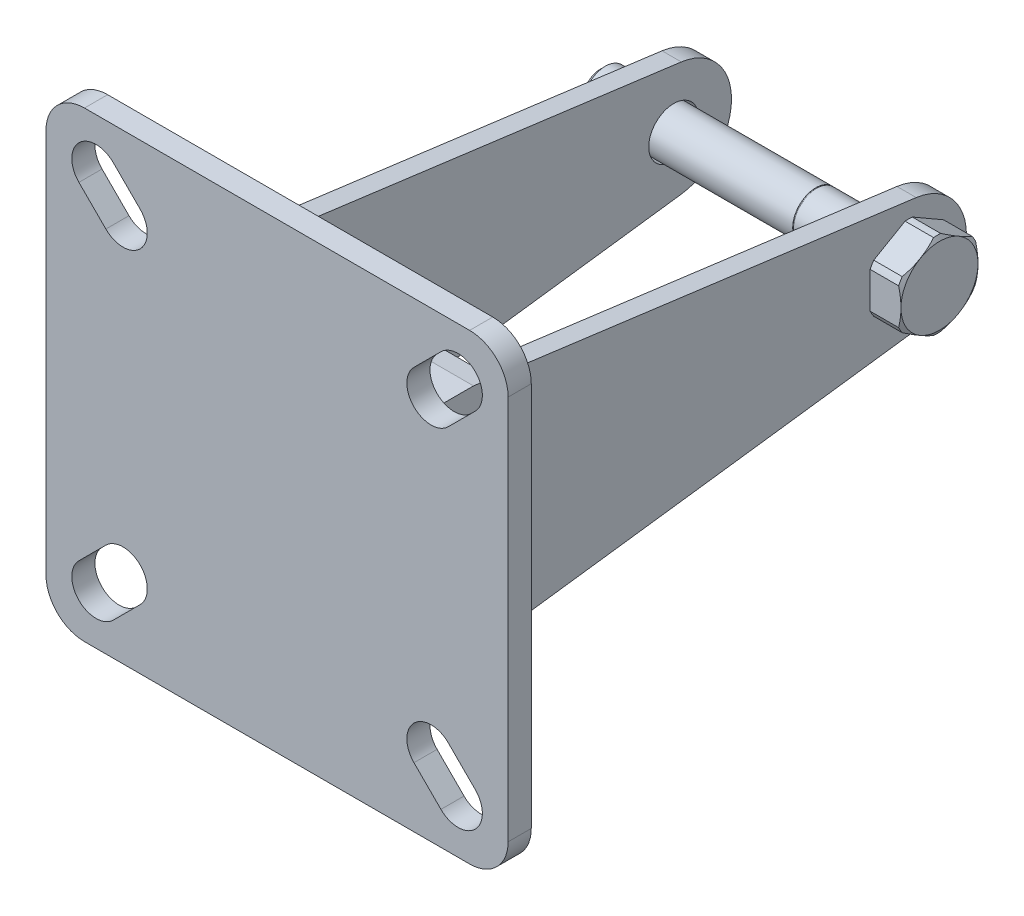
ISO-10303-21;
HEADER;
FILE_DESCRIPTION(('STEP AP214'),'2;1');
FILE_NAME('part.step','',(''),(''),'','','');
FILE_SCHEMA(('AUTOMOTIVE_DESIGN { 1 0 10303 214 1 1 1 1 }'));
ENDSEC;
DATA;
#1=APPLICATION_CONTEXT('core data for automotive mechanical design processes');
#2=APPLICATION_PROTOCOL_DEFINITION('international standard','automotive_design',2000,#1);
#3=PRODUCT_CONTEXT('',#1,'mechanical');
#4=PRODUCT('Part','Part','',(#3));
#5=PRODUCT_RELATED_PRODUCT_CATEGORY('part','',(#4));
#6=PRODUCT_DEFINITION_FORMATION('','',#4);
#7=PRODUCT_DEFINITION_CONTEXT('part definition',#1,'design');
#8=PRODUCT_DEFINITION('design','',#6,#7);
#9=PRODUCT_DEFINITION_SHAPE('','',#8);
#10=(LENGTH_UNIT() NAMED_UNIT(*) SI_UNIT(.MILLI.,.METRE.));
#11=(NAMED_UNIT(*) PLANE_ANGLE_UNIT() SI_UNIT($,.RADIAN.));
#12=(NAMED_UNIT(*) SI_UNIT($,.STERADIAN.) SOLID_ANGLE_UNIT());
#13=UNCERTAINTY_MEASURE_WITH_UNIT(LENGTH_MEASURE(1.E-05),#10,'distance_accuracy_value','');
#14=(GEOMETRIC_REPRESENTATION_CONTEXT(3) GLOBAL_UNCERTAINTY_ASSIGNED_CONTEXT((#13)) GLOBAL_UNIT_ASSIGNED_CONTEXT((#10,
#11,#12)) REPRESENTATION_CONTEXT('',''));
#15=CARTESIAN_POINT('',(0.,0.,0.));
#16=DIRECTION('',(0.,0.,1.));
#17=DIRECTION('',(1.,0.,0.));
#18=AXIS2_PLACEMENT_3D('',#15,#16,#17);
#19=CARTESIAN_POINT('',(-23.5,0.,-62.5));
#20=DIRECTION('',(1.,0.,0.));
#21=DIRECTION('',(0.,0.,-1.));
#22=AXIS2_PLACEMENT_3D('',#19,#20,#21);
#23=PLANE('',#22);
#24=CARTESIAN_POINT('',(-23.4999999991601,0.,-62.5));
#25=DIRECTION('',(1.,0.,0.));
#26=DIRECTION('',(0.,0.,-1.));
#27=AXIS2_PLACEMENT_3D('',#24,#25,#26);
#28=CIRCLE('',#27,2.38654999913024);
#29=CARTESIAN_POINT('',(-23.4999999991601,0.,-64.8865499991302));
#30=VERTEX_POINT('',#29);
#31=EDGE_CURVE('E19',#30,#30,#28,.T.);
#32=ORIENTED_EDGE('',*,*,#31,.F.);
#33=EDGE_LOOP('',(#32));
#34=FACE_BOUND('',#33,.T.);
#35=ADVANCED_FACE('F16',(#34),#23,.F.);
#36=CARTESIAN_POINT('',(-22.8865499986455,0.,-62.5));
#37=DIRECTION('',(1.,0.,0.));
#38=DIRECTION('',(0.,0.,-1.));
#39=AXIS2_PLACEMENT_3D('',#36,#37,#38);
#40=CONICAL_SURFACE('',#39,2.99999999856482,0.785398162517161);
#41=CARTESIAN_POINT('',(-22.88655,0.,-62.5));
#42=DIRECTION('',(-1.,0.,0.));
#43=DIRECTION('',(0.,0.,1.));
#44=AXIS2_PLACEMENT_3D('',#41,#42,#43);
#45=CIRCLE('',#44,3.);
#46=CARTESIAN_POINT('',(-22.88655,0.,-59.5));
#47=VERTEX_POINT('',#46);
#48=EDGE_CURVE('E508',#47,#47,#45,.F.);
#49=ORIENTED_EDGE('',*,*,#48,.F.);
#50=EDGE_LOOP('',(#49));
#51=FACE_BOUND('',#50,.T.);
#52=ORIENTED_EDGE('',*,*,#31,.T.);
#53=EDGE_LOOP('',(#52));
#54=FACE_BOUND('',#53,.T.);
#55=ADVANCED_FACE('F921',(#51,#54),#40,.T.);
#56=CARTESIAN_POINT('',(-3.193275,0.,-62.5));
#57=DIRECTION('',(-1.,0.,0.));
#58=DIRECTION('',(0.,0.,1.));
#59=AXIS2_PLACEMENT_3D('',#56,#57,#58);
#60=CYLINDRICAL_SURFACE('',#59,3.);
#61=ORIENTED_EDGE('',*,*,#48,.T.);
#62=EDGE_LOOP('',(#61));
#63=FACE_BOUND('',#62,.T.);
#64=CARTESIAN_POINT('',(4.44,0.,-62.5));
#65=DIRECTION('',(-1.,0.,0.));
#66=DIRECTION('',(0.,0.,1.));
#67=AXIS2_PLACEMENT_3D('',#64,#65,#66);
#68=CIRCLE('',#67,3.);
#69=CARTESIAN_POINT('',(4.44,0.,-59.5));
#70=VERTEX_POINT('',#69);
#71=EDGE_CURVE('E504',#70,#70,#68,.T.);
#72=ORIENTED_EDGE('',*,*,#71,.T.);
#73=EDGE_LOOP('',(#72));
#74=FACE_BOUND('',#73,.T.);
#75=ADVANCED_FACE('F497',(#63,#74),#60,.T.);
#76=CARTESIAN_POINT('',(4.5,0.,-62.5));
#77=DIRECTION('',(-1.,0.,0.));
#78=DIRECTION('',(0.,0.,1.));
#79=AXIS2_PLACEMENT_3D('',#76,#77,#78);
#80=TOROIDAL_SURFACE('',#79,3.,0.06);
#81=CARTESIAN_POINT('',(4.56,0.,-62.5));
#82=DIRECTION('',(-1.,0.,0.));
#83=DIRECTION('',(0.,0.,1.));
#84=AXIS2_PLACEMENT_3D('',#81,#82,#83);
#85=CIRCLE('',#84,3.);
#86=CARTESIAN_POINT('',(4.56,0.,-59.5));
#87=VERTEX_POINT('',#86);
#88=EDGE_CURVE('E507',#87,#87,#85,.F.);
#89=ORIENTED_EDGE('',*,*,#88,.F.);
#90=EDGE_LOOP('',(#89));
#91=FACE_BOUND('',#90,.T.);
#92=ORIENTED_EDGE('',*,*,#71,.F.);
#93=EDGE_LOOP('',(#92));
#94=FACE_BOUND('',#93,.T.);
#95=ADVANCED_FACE('F492',(#91,#94),#80,.F.);
#96=CARTESIAN_POINT('',(-3.193275,0.,-62.5));
#97=DIRECTION('',(-1.,0.,0.));
#98=DIRECTION('',(0.,0.,1.));
#99=AXIS2_PLACEMENT_3D('',#96,#97,#98);
#100=CYLINDRICAL_SURFACE('',#99,3.);
#101=ORIENTED_EDGE('',*,*,#88,.T.);
#102=EDGE_LOOP('',(#101));
#103=FACE_BOUND('',#102,.T.);
#104=CARTESIAN_POINT('',(16.25,0.,-62.5));
#105=DIRECTION('',(-1.,0.,0.));
#106=DIRECTION('',(0.,0.,1.));
#107=AXIS2_PLACEMENT_3D('',#104,#105,#106);
#108=CIRCLE('',#107,3.);
#109=CARTESIAN_POINT('',(16.25,0.,-59.5));
#110=VERTEX_POINT('',#109);
#111=EDGE_CURVE('E475',#110,#110,#108,.T.);
#112=ORIENTED_EDGE('',*,*,#111,.T.);
#113=EDGE_LOOP('',(#112));
#114=FACE_BOUND('',#113,.T.);
#115=ADVANCED_FACE('F487',(#103,#114),#100,.T.);
#116=CARTESIAN_POINT('',(16.25,0.,-62.5));
#117=DIRECTION('',(-1.,0.,0.));
#118=DIRECTION('',(0.,0.,1.));
#119=AXIS2_PLACEMENT_3D('',#116,#117,#118);
#120=TOROIDAL_SURFACE('',#119,3.25,0.25);
#121=CARTESIAN_POINT('',(16.5,0.,-62.5));
#122=DIRECTION('',(1.,0.,0.));
#123=DIRECTION('',(0.,0.,-1.));
#124=AXIS2_PLACEMENT_3D('',#121,#122,#123);
#125=CIRCLE('',#124,3.25);
#126=CARTESIAN_POINT('',(16.5,0.,-65.75));
#127=VERTEX_POINT('',#126);
#128=EDGE_CURVE('E310',#127,#127,#125,.F.);
#129=ORIENTED_EDGE('',*,*,#128,.T.);
#130=EDGE_LOOP('',(#129));
#131=FACE_BOUND('',#130,.T.);
#132=ORIENTED_EDGE('',*,*,#111,.F.);
#133=EDGE_LOOP('',(#132));
#134=FACE_BOUND('',#133,.T.);
#135=ADVANCED_FACE('F482',(#131,#134),#120,.F.);
#136=CARTESIAN_POINT('',(20.5,0.,-62.5));
#137=DIRECTION('',(-1.,0.,0.));
#138=DIRECTION('',(0.,0.,1.));
#139=AXIS2_PLACEMENT_3D('',#136,#137,#138);
#140=PLANE('',#139);
#141=CARTESIAN_POINT('',(20.4999999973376,0.,-62.5));
#142=DIRECTION('',(-1.,0.,0.));
#143=DIRECTION('',(0.,0.,1.));
#144=AXIS2_PLACEMENT_3D('',#141,#142,#143);
#145=CIRCLE('',#144,4.99999999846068);
#146=CARTESIAN_POINT('',(20.4999999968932,-4.33012701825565,-60.0000000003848));
#147=VERTEX_POINT('',#146);
#148=CARTESIAN_POINT('',(20.4999999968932,0.,-57.5000000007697));
#149=VERTEX_POINT('',#148);
#150=EDGE_CURVE('E309',#147,#149,#145,.T.);
#151=ORIENTED_EDGE('',*,*,#150,.F.);
#152=CARTESIAN_POINT('',(20.4999999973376,0.,-62.5));
#153=DIRECTION('',(-1.,0.,0.));
#154=DIRECTION('',(0.,0.,1.));
#155=AXIS2_PLACEMENT_3D('',#152,#153,#154);
#156=CIRCLE('',#155,4.99999999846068);
#157=CARTESIAN_POINT('',(20.4999999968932,-4.33012701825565,-64.9999999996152));
#158=VERTEX_POINT('',#157);
#159=EDGE_CURVE('E452',#158,#147,#156,.T.);
#160=ORIENTED_EDGE('',*,*,#159,.F.);
#161=CARTESIAN_POINT('',(20.4999999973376,0.,-62.5));
#162=DIRECTION('',(-1.,0.,0.));
#163=DIRECTION('',(0.,0.,1.));
#164=AXIS2_PLACEMENT_3D('',#161,#162,#163);
#165=CIRCLE('',#164,4.99999999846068);
#166=CARTESIAN_POINT('',(20.4999999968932,0.,-67.4999999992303));
#167=VERTEX_POINT('',#166);
#168=EDGE_CURVE('E453',#167,#158,#165,.T.);
#169=ORIENTED_EDGE('',*,*,#168,.F.);
#170=CARTESIAN_POINT('',(20.4999999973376,0.,-62.5));
#171=DIRECTION('',(-1.,0.,0.));
#172=DIRECTION('',(0.,0.,1.));
#173=AXIS2_PLACEMENT_3D('',#170,#171,#172);
#174=CIRCLE('',#173,4.99999999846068);
#175=CARTESIAN_POINT('',(20.4999999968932,4.33012701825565,-64.9999999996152));
#176=VERTEX_POINT('',#175);
#177=EDGE_CURVE('E461',#176,#167,#174,.T.);
#178=ORIENTED_EDGE('',*,*,#177,.F.);
#179=CARTESIAN_POINT('',(20.4999999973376,0.,-62.5));
#180=DIRECTION('',(-1.,0.,0.));
#181=DIRECTION('',(0.,0.,1.));
#182=AXIS2_PLACEMENT_3D('',#179,#180,#181);
#183=CIRCLE('',#182,4.99999999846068);
#184=CARTESIAN_POINT('',(20.4999999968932,4.33012701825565,-60.0000000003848));
#185=VERTEX_POINT('',#184);
#186=EDGE_CURVE('E465',#185,#176,#183,.T.);
#187=ORIENTED_EDGE('',*,*,#186,.F.);
#188=CARTESIAN_POINT('',(20.4999999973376,0.,-62.5));
#189=DIRECTION('',(-1.,0.,0.));
#190=DIRECTION('',(0.,0.,1.));
#191=AXIS2_PLACEMENT_3D('',#188,#189,#190);
#192=CIRCLE('',#191,4.99999999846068);
#193=EDGE_CURVE('E469',#149,#185,#192,.T.);
#194=ORIENTED_EDGE('',*,*,#193,.F.);
#195=EDGE_LOOP('',(#151,#160,#169,#178,#187,#194));
#196=FACE_BOUND('',#195,.T.);
#197=ADVANCED_FACE('F486',(#196),#140,.F.);
#198=CARTESIAN_POINT('',(0.,0.,-62.5));
#199=DIRECTION('',(1.,0.,0.));
#200=DIRECTION('',(0.,0.,-1.));
#201=AXIS2_PLACEMENT_3D('',#198,#199,#200);
#202=CYLINDRICAL_SURFACE('',#201,3.25);
#203=CARTESIAN_POINT('',(14.,0.,-62.5));
#204=DIRECTION('',(1.,0.,0.));
#205=DIRECTION('',(0.,0.,-1.));
#206=AXIS2_PLACEMENT_3D('',#203,#204,#205);
#207=CIRCLE('',#206,3.25);
#208=CARTESIAN_POINT('',(14.,0.,-65.75));
#209=VERTEX_POINT('',#208);
#210=EDGE_CURVE('E439',#209,#209,#207,.T.);
#211=ORIENTED_EDGE('',*,*,#210,.F.);
#212=EDGE_LOOP('',(#211));
#213=FACE_BOUND('',#212,.T.);
#214=ORIENTED_EDGE('',*,*,#128,.F.);
#215=EDGE_LOOP('',(#214));
#216=FACE_BOUND('',#215,.T.);
#217=ADVANCED_FACE('F901',(#213,#216),#202,.F.);
#218=CARTESIAN_POINT('',(18.3484455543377,0.,-62.5));
#219=DIRECTION('',(-1.,0.,0.));
#220=DIRECTION('',(0.,0.,1.));
#221=AXIS2_PLACEMENT_3D('',#218,#219,#220);
#222=CYLINDRICAL_SURFACE('',#221,5.525);
#223=DIRECTION('',(1.,0.,0.));
#224=VECTOR('',#223,1.);
#225=CARTESIAN_POINT('',(18.5,-2.3506647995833,-57.5));
#226=LINE('',#225,#224);
#227=CARTESIAN_POINT('',(16.5,-2.35066479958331,-57.5));
#228=VERTEX_POINT('',#227);
#229=CARTESIAN_POINT('',(20.1968911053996,-2.35066479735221,-57.5));
#230=VERTEX_POINT('',#229);
#231=EDGE_CURVE('E307',#228,#230,#226,.T.);
#232=ORIENTED_EDGE('',*,*,#231,.F.);
#233=CARTESIAN_POINT('',(16.5,0.,-62.5));
#234=DIRECTION('',(-1.,0.,0.));
#235=DIRECTION('',(0.,0.,1.));
#236=AXIS2_PLACEMENT_3D('',#233,#234,#235);
#237=CIRCLE('',#236,5.525);
#238=CARTESIAN_POINT('',(16.5,-3.15479461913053,-57.964264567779));
#239=VERTEX_POINT('',#238);
#240=EDGE_CURVE('E299',#228,#239,#237,.F.);
#241=ORIENTED_EDGE('',*,*,#240,.T.);
#242=DIRECTION('',(1.,0.,0.));
#243=VECTOR('',#242,1.);
#244=CARTESIAN_POINT('',(18.5,-3.15479461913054,-57.964264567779));
#245=LINE('',#244,#243);
#246=CARTESIAN_POINT('',(20.1968911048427,-3.15479462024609,-57.9642645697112));
#247=VERTEX_POINT('',#246);
#248=EDGE_CURVE('E304',#247,#239,#245,.F.);
#249=ORIENTED_EDGE('',*,*,#248,.F.);
#250=CARTESIAN_POINT('',(20.1968911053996,0.,-62.5));
#251=DIRECTION('',(-1.,0.,0.));
#252=DIRECTION('',(0.,0.,1.));
#253=AXIS2_PLACEMENT_3D('',#250,#251,#252);
#254=CIRCLE('',#253,5.52499999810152);
#255=EDGE_CURVE('E471',#230,#247,#254,.F.);
#256=ORIENTED_EDGE('',*,*,#255,.F.);
#257=EDGE_LOOP('',(#232,#241,#249,#256));
#258=FACE_BOUND('',#257,.T.);
#259=ADVANCED_FACE('F303',(#258),#222,.T.);
#260=CARTESIAN_POINT('',(20.1968911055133,0.,-62.5));
#261=DIRECTION('',(-1.,0.,0.));
#262=DIRECTION('',(0.,0.,1.));
#263=AXIS2_PLACEMENT_3D('',#260,#261,#262);
#264=CONICAL_SURFACE('',#263,5.52499999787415,1.04719754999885);
#265=CARTESIAN_POINT('',(20.1968911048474,-2.35066479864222,-57.4999999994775));
#266=CARTESIAN_POINT('',(20.2442122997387,-2.15813567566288,-57.499999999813));
#267=CARTESIAN_POINT('',(20.2870164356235,-1.96441468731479,-57.49999999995));
#268=CARTESIAN_POINT('',(20.3618864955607,-1.57566553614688,-57.5000000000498));
#269=CARTESIAN_POINT('',(20.3939915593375,-1.3806448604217,-57.5000000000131));
#270=CARTESIAN_POINT('',(20.4461471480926,-0.988832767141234,-57.4999999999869));
#271=CARTESIAN_POINT('',(20.4661908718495,-0.792040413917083,-57.4999999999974));
#272=CARTESIAN_POINT('',(20.4863966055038,-0.495838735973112,-57.5000000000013));
#273=CARTESIAN_POINT('',(20.4914887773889,-0.396747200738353,-57.5000000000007));
#274=CARTESIAN_POINT('',(20.4982940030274,-0.198439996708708,-57.4999999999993));
#275=CARTESIAN_POINT('',(20.500006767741,-0.0992243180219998,-57.4999999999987));
#276=CARTESIAN_POINT('',(20.4999999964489,5.44889504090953E-11,-57.5));
#277=B_SPLINE_CURVE_WITH_KNOTS('',3,(#265,#266,#267,#268,#269,#270,#271,#272,#273,#274,#275,
#276),.UNSPECIFIED.,.F.,.F.,(4,2,2,2,2,4),(0.,0.594838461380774,1.18747634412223,
1.78044809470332,2.07806432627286,2.3757060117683),.UNSPECIFIED.);
#278=EDGE_CURVE('E413',#230,#149,#277,.T.);
#279=ORIENTED_EDGE('',*,*,#278,.F.);
#280=ORIENTED_EDGE('',*,*,#255,.T.);
#281=CARTESIAN_POINT('',(20.4999999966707,-4.33012701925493,-59.9999999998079));
#282=CARTESIAN_POINT('',(20.5000067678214,-4.2805148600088,-59.9140692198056));
#283=CARTESIAN_POINT('',(20.4982940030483,-4.23090702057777,-59.828145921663));
#284=CARTESIAN_POINT('',(20.4914887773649,-4.13175341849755,-59.6564068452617));
#285=CARTESIAN_POINT('',(20.4863966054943,-4.08220765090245,-59.5705910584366));
#286=CARTESIAN_POINT('',(20.4661908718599,-3.93410681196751,-59.3140728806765));
#287=CARTESIAN_POINT('',(20.446147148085,-3.83571063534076,-59.143645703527));
#288=CARTESIAN_POINT('',(20.3939915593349,-3.63980458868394,-58.8043264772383));
#289=CARTESIAN_POINT('',(20.3618864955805,-3.54229425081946,-58.6354336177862));
#290=CARTESIAN_POINT('',(20.2870164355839,-3.34791967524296,-58.2987669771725));
#291=CARTESIAN_POINT('',(20.2442122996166,-3.2510591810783,-58.1309996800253));
#292=CARTESIAN_POINT('',(20.1968911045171,-3.15479461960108,-57.964264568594));
#293=B_SPLINE_CURVE_WITH_KNOTS('',3,(#281,#282,#283,#284,#285,#286,#287,#288,#289,#290,#291,
#292),.UNSPECIFIED.,.F.,.F.,(4,2,2,2,2,4),(0.,0.297641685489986,0.595257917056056,
1.18822966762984,1.78086755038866,2.37570601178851),.UNSPECIFIED.);
#294=EDGE_CURVE('E319',#147,#247,#293,.T.);
#295=ORIENTED_EDGE('',*,*,#294,.F.);
#296=ORIENTED_EDGE('',*,*,#150,.T.);
#297=EDGE_LOOP('',(#279,#280,#295,#296));
#298=FACE_BOUND('',#297,.T.);
#299=ADVANCED_FACE('F875',(#298),#264,.T.);
#300=CARTESIAN_POINT('',(18.3484455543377,0.,-62.5));
#301=DIRECTION('',(-1.,0.,0.));
#302=DIRECTION('',(0.,0.,1.));
#303=AXIS2_PLACEMENT_3D('',#300,#301,#302);
#304=CYLINDRICAL_SURFACE('',#303,5.525);
#305=DIRECTION('',(1.,0.,0.));
#306=VECTOR('',#305,1.);
#307=CARTESIAN_POINT('',(18.5,2.3506647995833,-57.5));
#308=LINE('',#307,#306);
#309=CARTESIAN_POINT('',(20.1968911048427,2.35066479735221,-57.5));
#310=VERTEX_POINT('',#309);
#311=CARTESIAN_POINT('',(16.5,2.35066479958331,-57.5));
#312=VERTEX_POINT('',#311);
#313=EDGE_CURVE('E408',#310,#312,#308,.F.);
#314=ORIENTED_EDGE('',*,*,#313,.F.);
#315=CARTESIAN_POINT('',(20.1968911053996,0.,-62.5));
#316=DIRECTION('',(-1.,0.,0.));
#317=DIRECTION('',(0.,0.,1.));
#318=AXIS2_PLACEMENT_3D('',#315,#316,#317);
#319=CIRCLE('',#318,5.52499999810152);
#320=CARTESIAN_POINT('',(20.1968911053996,3.1547946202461,-57.9642645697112));
#321=VERTEX_POINT('',#320);
#322=EDGE_CURVE('E467',#321,#310,#319,.F.);
#323=ORIENTED_EDGE('',*,*,#322,.F.);
#324=DIRECTION('',(1.,0.,0.));
#325=VECTOR('',#324,1.);
#326=CARTESIAN_POINT('',(18.5,3.15479461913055,-57.964264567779));
#327=LINE('',#326,#325);
#328=CARTESIAN_POINT('',(16.5,3.15479461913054,-57.964264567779));
#329=VERTEX_POINT('',#328);
#330=EDGE_CURVE('E404',#329,#321,#327,.T.);
#331=ORIENTED_EDGE('',*,*,#330,.F.);
#332=CARTESIAN_POINT('',(16.5,0.,-62.5));
#333=DIRECTION('',(-1.,0.,0.));
#334=DIRECTION('',(0.,0.,1.));
#335=AXIS2_PLACEMENT_3D('',#332,#333,#334);
#336=CIRCLE('',#335,5.525);
#337=EDGE_CURVE('E470',#329,#312,#336,.F.);
#338=ORIENTED_EDGE('',*,*,#337,.T.);
#339=EDGE_LOOP('',(#314,#323,#331,#338));
#340=FACE_BOUND('',#339,.T.);
#341=ADVANCED_FACE('F898',(#340),#304,.T.);
#342=CARTESIAN_POINT('',(20.1968911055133,0.,-62.5));
#343=DIRECTION('',(-1.,0.,0.));
#344=DIRECTION('',(0.,0.,1.));
#345=AXIS2_PLACEMENT_3D('',#342,#343,#344);
#346=CONICAL_SURFACE('',#345,5.52499999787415,1.04719754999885);
#347=CARTESIAN_POINT('',(20.4999999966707,0.,-57.4999999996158));
#348=CARTESIAN_POINT('',(20.5000067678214,0.0992243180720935,-57.4999999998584));
#349=CARTESIAN_POINT('',(20.4982940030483,0.198439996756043,-57.4999999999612));
#350=CARTESIAN_POINT('',(20.4914887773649,0.396747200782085,-57.5000000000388));
#351=CARTESIAN_POINT('',(20.4863966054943,0.495838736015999,-57.5000000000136));
#352=CARTESIAN_POINT('',(20.4661908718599,0.792040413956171,-57.499999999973));
#353=CARTESIAN_POINT('',(20.446147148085,0.988832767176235,-57.4999999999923));
#354=CARTESIAN_POINT('',(20.3939915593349,1.38064486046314,-57.5000000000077));
#355=CARTESIAN_POINT('',(20.3618864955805,1.57566553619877,-57.5000000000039));
#356=CARTESIAN_POINT('',(20.2870164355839,1.96441468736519,-57.4999999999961));
#357=CARTESIAN_POINT('',(20.2442122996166,2.15813567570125,-57.4999999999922));
#358=CARTESIAN_POINT('',(20.1968911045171,2.35066479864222,-57.5));
#359=B_SPLINE_CURVE_WITH_KNOTS('',3,(#347,#348,#349,#350,#351,#352,#353,#354,#355,#356,#357,
#358),.UNSPECIFIED.,.F.,.F.,(4,2,2,2,2,4),(0.,0.297641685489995,0.59525791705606,
1.18822966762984,1.78086755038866,2.37570601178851),.UNSPECIFIED.);
#360=EDGE_CURVE('E411',#149,#310,#359,.T.);
#361=ORIENTED_EDGE('',*,*,#360,.F.);
#362=ORIENTED_EDGE('',*,*,#193,.T.);
#363=CARTESIAN_POINT('',(20.1968911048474,3.15479462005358,-57.9642645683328));
#364=CARTESIAN_POINT('',(20.2442122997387,3.25105918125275,-58.1309996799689));
#365=CARTESIAN_POINT('',(20.2870164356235,3.34791967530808,-58.2987669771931));
#366=CARTESIAN_POINT('',(20.3618864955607,3.54229425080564,-58.6354336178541));
#367=CARTESIAN_POINT('',(20.3939915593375,3.63980458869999,-58.8043264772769));
#368=CARTESIAN_POINT('',(20.4461471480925,3.83571063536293,-59.1436457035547));
#369=CARTESIAN_POINT('',(20.4661908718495,3.93410681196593,-59.3140728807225));
#370=CARTESIAN_POINT('',(20.4863966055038,4.0822076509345,-59.5705910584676));
#371=CARTESIAN_POINT('',(20.4914887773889,4.13175341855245,-59.6564068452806));
#372=CARTESIAN_POINT('',(20.4982940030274,4.23090702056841,-59.828145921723));
#373=CARTESIAN_POINT('',(20.500006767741,4.28051485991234,-59.9140692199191));
#374=CARTESIAN_POINT('',(20.4999999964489,4.33012701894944,-60.0000000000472));
#375=B_SPLINE_CURVE_WITH_KNOTS('',3,(#363,#364,#365,#366,#367,#368,#369,#370,#371,#372,#373,
#374),.UNSPECIFIED.,.F.,.F.,(4,2,2,2,2,4),(0.,0.594838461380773,1.18747634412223,
1.78044809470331,2.07806432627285,2.37570601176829),.UNSPECIFIED.);
#376=EDGE_CURVE('E407',#321,#185,#375,.T.);
#377=ORIENTED_EDGE('',*,*,#376,.F.);
#378=ORIENTED_EDGE('',*,*,#322,.T.);
#379=EDGE_LOOP('',(#361,#362,#377,#378));
#380=FACE_BOUND('',#379,.T.);
#381=ADVANCED_FACE('F881',(#380),#346,.T.);
#382=CARTESIAN_POINT('',(18.3484455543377,0.,-62.5));
#383=DIRECTION('',(-1.,0.,0.));
#384=DIRECTION('',(0.,0.,1.));
#385=AXIS2_PLACEMENT_3D('',#382,#383,#384);
#386=CYLINDRICAL_SURFACE('',#385,5.525);
#387=DIRECTION('',(1.,0.,0.));
#388=VECTOR('',#387,1.);
#389=CARTESIAN_POINT('',(18.5,5.50545941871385,-62.035735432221));
#390=LINE('',#389,#388);
#391=CARTESIAN_POINT('',(20.1968911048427,5.5054594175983,-62.0357354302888));
#392=VERTEX_POINT('',#391);
#393=CARTESIAN_POINT('',(16.5,5.50545941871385,-62.035735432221));
#394=VERTEX_POINT('',#393);
#395=EDGE_CURVE('E400',#392,#394,#390,.F.);
#396=ORIENTED_EDGE('',*,*,#395,.F.);
#397=CARTESIAN_POINT('',(20.1968911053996,0.,-62.5));
#398=DIRECTION('',(-1.,0.,0.));
#399=DIRECTION('',(0.,0.,1.));
#400=AXIS2_PLACEMENT_3D('',#397,#398,#399);
#401=CIRCLE('',#400,5.52499999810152);
#402=CARTESIAN_POINT('',(20.1968911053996,5.5054594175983,-62.9642645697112));
#403=VERTEX_POINT('',#402);
#404=EDGE_CURVE('E463',#403,#392,#401,.F.);
#405=ORIENTED_EDGE('',*,*,#404,.F.);
#406=DIRECTION('',(1.,0.,0.));
#407=VECTOR('',#406,1.);
#408=CARTESIAN_POINT('',(18.5,5.50545941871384,-62.964264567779));
#409=LINE('',#408,#407);
#410=CARTESIAN_POINT('',(16.5,5.50545941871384,-62.964264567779));
#411=VERTEX_POINT('',#410);
#412=EDGE_CURVE('E393',#411,#403,#409,.T.);
#413=ORIENTED_EDGE('',*,*,#412,.F.);
#414=CARTESIAN_POINT('',(16.5,0.,-62.5));
#415=DIRECTION('',(-1.,0.,0.));
#416=DIRECTION('',(0.,0.,1.));
#417=AXIS2_PLACEMENT_3D('',#414,#415,#416);
#418=CIRCLE('',#417,5.525);
#419=EDGE_CURVE('E466',#411,#394,#418,.F.);
#420=ORIENTED_EDGE('',*,*,#419,.T.);
#421=EDGE_LOOP('',(#396,#405,#413,#420));
#422=FACE_BOUND('',#421,.T.);
#423=ADVANCED_FACE('F861',(#422),#386,.T.);
#424=CARTESIAN_POINT('',(20.1968911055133,0.,-62.5));
#425=DIRECTION('',(-1.,0.,0.));
#426=DIRECTION('',(0.,0.,1.));
#427=AXIS2_PLACEMENT_3D('',#424,#425,#426);
#428=CONICAL_SURFACE('',#427,5.52499999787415,1.04719754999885);
#429=CARTESIAN_POINT('',(20.4999999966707,4.33012701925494,-59.9999999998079));
#430=CARTESIAN_POINT('',(20.5000067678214,4.3797391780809,-60.0859307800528));
#431=CARTESIAN_POINT('',(20.4982940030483,4.42934701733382,-60.1718540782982));
#432=CARTESIAN_POINT('',(20.4914887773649,4.52850061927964,-60.343593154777));
#433=CARTESIAN_POINT('',(20.4863966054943,4.57804638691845,-60.429408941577));
#434=CARTESIAN_POINT('',(20.4661908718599,4.72614722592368,-60.6859271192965));
#435=CARTESIAN_POINT('',(20.446147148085,4.824543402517,-60.8563542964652));
#436=CARTESIAN_POINT('',(20.3939915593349,5.02044944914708,-61.1956735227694));
#437=CARTESIAN_POINT('',(20.3618864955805,5.11795978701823,-61.3645663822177));
#438=CARTESIAN_POINT('',(20.2870164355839,5.31233436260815,-61.7012330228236));
#439=CARTESIAN_POINT('',(20.2442122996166,5.40919485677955,-61.8690003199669));
#440=CARTESIAN_POINT('',(20.1968911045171,5.50545941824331,-62.035735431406));
#441=B_SPLINE_CURVE_WITH_KNOTS('',3,(#429,#430,#431,#432,#433,#434,#435,#436,#437,#438,#439,
#440),.UNSPECIFIED.,.F.,.F.,(4,2,2,2,2,4),(0.,0.297641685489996,0.595257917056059,
1.18822966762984,1.78086755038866,2.37570601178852),.UNSPECIFIED.);
#442=EDGE_CURVE('E403',#185,#392,#441,.T.);
#443=ORIENTED_EDGE('',*,*,#442,.F.);
#444=ORIENTED_EDGE('',*,*,#186,.T.);
#445=CARTESIAN_POINT('',(20.1968911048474,5.50545941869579,-62.9642645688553));
#446=CARTESIAN_POINT('',(20.2442122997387,5.40919485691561,-63.130999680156));
#447=CARTESIAN_POINT('',(20.2870164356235,5.31233436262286,-63.2987669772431));
#448=CARTESIAN_POINT('',(20.3618864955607,5.11795978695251,-63.6354336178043));
#449=CARTESIAN_POINT('',(20.3939915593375,5.02044944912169,-63.8043264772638));
#450=CARTESIAN_POINT('',(20.4461471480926,4.82454340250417,-64.1436457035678));
#451=CARTESIAN_POINT('',(20.4661908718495,4.72614722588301,-64.3140728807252));
#452=CARTESIAN_POINT('',(20.4863966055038,4.57804638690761,-64.5705910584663));
#453=CARTESIAN_POINT('',(20.4914887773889,4.5285006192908,-64.6564068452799));
#454=CARTESIAN_POINT('',(20.4982940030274,4.42934701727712,-64.8281459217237));
#455=CARTESIAN_POINT('',(20.500006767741,4.37973917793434,-64.9140692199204));
#456=CARTESIAN_POINT('',(20.4999999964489,4.33012701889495,-65.0000000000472));
#457=B_SPLINE_CURVE_WITH_KNOTS('',3,(#445,#446,#447,#448,#449,#450,#451,#452,#453,#454,#455,
#456),.UNSPECIFIED.,.F.,.F.,(4,2,2,2,2,4),(0.,0.594838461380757,1.18747634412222,
1.78044809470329,2.07806432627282,2.37570601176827),.UNSPECIFIED.);
#458=EDGE_CURVE('E396',#403,#176,#457,.T.);
#459=ORIENTED_EDGE('',*,*,#458,.F.);
#460=ORIENTED_EDGE('',*,*,#404,.T.);
#461=EDGE_LOOP('',(#443,#444,#459,#460));
#462=FACE_BOUND('',#461,.T.);
#463=ADVANCED_FACE('F990',(#462),#428,.T.);
#464=CARTESIAN_POINT('',(18.3484455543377,0.,-62.5));
#465=DIRECTION('',(-1.,0.,0.));
#466=DIRECTION('',(0.,0.,1.));
#467=AXIS2_PLACEMENT_3D('',#464,#465,#466);
#468=CYLINDRICAL_SURFACE('',#467,5.525);
#469=DIRECTION('',(1.,0.,0.));
#470=VECTOR('',#469,1.);
#471=CARTESIAN_POINT('',(18.5,3.15479461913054,-67.035735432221));
#472=LINE('',#471,#470);
#473=CARTESIAN_POINT('',(20.1968911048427,3.15479462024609,-67.0357354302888));
#474=VERTEX_POINT('',#473);
#475=CARTESIAN_POINT('',(16.5,3.15479461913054,-67.035735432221));
#476=VERTEX_POINT('',#475);
#477=EDGE_CURVE('E397',#474,#476,#472,.F.);
#478=ORIENTED_EDGE('',*,*,#477,.F.);
#479=CARTESIAN_POINT('',(20.1968911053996,0.,-62.5));
#480=DIRECTION('',(-1.,0.,0.));
#481=DIRECTION('',(0.,0.,1.));
#482=AXIS2_PLACEMENT_3D('',#479,#480,#481);
#483=CIRCLE('',#482,5.52499999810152);
#484=CARTESIAN_POINT('',(20.1968911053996,2.3506647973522,-67.5));
#485=VERTEX_POINT('',#484);
#486=EDGE_CURVE('E458',#485,#474,#483,.F.);
#487=ORIENTED_EDGE('',*,*,#486,.F.);
#488=DIRECTION('',(-1.,0.,0.));
#489=VECTOR('',#488,1.);
#490=CARTESIAN_POINT('',(18.5,2.3506647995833,-67.5));
#491=LINE('',#490,#489);
#492=CARTESIAN_POINT('',(16.5,2.3506647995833,-67.5));
#493=VERTEX_POINT('',#492);
#494=EDGE_CURVE('E385',#493,#485,#491,.F.);
#495=ORIENTED_EDGE('',*,*,#494,.F.);
#496=CARTESIAN_POINT('',(16.5,0.,-62.5));
#497=DIRECTION('',(-1.,0.,0.));
#498=DIRECTION('',(0.,0.,1.));
#499=AXIS2_PLACEMENT_3D('',#496,#497,#498);
#500=CIRCLE('',#499,5.525);
#501=EDGE_CURVE('E462',#493,#476,#500,.F.);
#502=ORIENTED_EDGE('',*,*,#501,.T.);
#503=EDGE_LOOP('',(#478,#487,#495,#502));
#504=FACE_BOUND('',#503,.T.);
#505=ADVANCED_FACE('F997',(#504),#468,.T.);
#506=CARTESIAN_POINT('',(20.1968911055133,0.,-62.5));
#507=DIRECTION('',(-1.,0.,0.));
#508=DIRECTION('',(0.,0.,1.));
#509=AXIS2_PLACEMENT_3D('',#506,#507,#508);
#510=CONICAL_SURFACE('',#509,5.52499999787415,1.04719754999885);
#511=CARTESIAN_POINT('',(20.4999999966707,4.33012701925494,-65.0000000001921));
#512=CARTESIAN_POINT('',(20.5000067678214,4.2805148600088,-65.0859307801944));
#513=CARTESIAN_POINT('',(20.4982940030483,4.23090702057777,-65.171854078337));
#514=CARTESIAN_POINT('',(20.4914887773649,4.13175341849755,-65.3435931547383));
#515=CARTESIAN_POINT('',(20.4863966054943,4.08220765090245,-65.4294089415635));
#516=CARTESIAN_POINT('',(20.4661908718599,3.93410681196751,-65.6859271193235));
#517=CARTESIAN_POINT('',(20.446147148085,3.83571063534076,-65.8563542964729));
#518=CARTESIAN_POINT('',(20.3939915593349,3.63980458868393,-66.1956735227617));
#519=CARTESIAN_POINT('',(20.3618864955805,3.54229425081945,-66.3645663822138));
#520=CARTESIAN_POINT('',(20.2870164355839,3.34791967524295,-66.7012330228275));
#521=CARTESIAN_POINT('',(20.2442122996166,3.2510591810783,-66.8690003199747));
#522=CARTESIAN_POINT('',(20.1968911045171,3.15479461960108,-67.035735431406));
#523=B_SPLINE_CURVE_WITH_KNOTS('',3,(#511,#512,#513,#514,#515,#516,#517,#518,#519,#520,#521,
#522),.UNSPECIFIED.,.F.,.F.,(4,2,2,2,2,4),(0.,0.297641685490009,0.595257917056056,
1.18822966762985,1.78086755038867,2.37570601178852),.UNSPECIFIED.);
#524=EDGE_CURVE('E392',#176,#474,#523,.T.);
#525=ORIENTED_EDGE('',*,*,#524,.F.);
#526=ORIENTED_EDGE('',*,*,#177,.T.);
#527=CARTESIAN_POINT('',(20.1968911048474,2.35066479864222,-67.5000000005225));
#528=CARTESIAN_POINT('',(20.2442122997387,2.15813567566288,-67.500000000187));
#529=CARTESIAN_POINT('',(20.2870164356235,1.96441468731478,-67.50000000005));
#530=CARTESIAN_POINT('',(20.3618864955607,1.57566553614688,-67.4999999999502));
#531=CARTESIAN_POINT('',(20.3939915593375,1.3806448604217,-67.4999999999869));
#532=CARTESIAN_POINT('',(20.4461471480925,0.988832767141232,-67.5000000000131));
#533=CARTESIAN_POINT('',(20.4661908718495,0.792040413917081,-67.5000000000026));
#534=CARTESIAN_POINT('',(20.4863966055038,0.49583873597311,-67.4999999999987));
#535=CARTESIAN_POINT('',(20.4914887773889,0.396747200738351,-67.4999999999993));
#536=CARTESIAN_POINT('',(20.4982940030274,0.198439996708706,-67.5000000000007));
#537=CARTESIAN_POINT('',(20.500006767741,0.0992243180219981,-67.5000000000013));
#538=CARTESIAN_POINT('',(20.4999999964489,-5.44909328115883E-11,-67.5));
#539=B_SPLINE_CURVE_WITH_KNOTS('',3,(#527,#528,#529,#530,#531,#532,#533,#534,#535,#536,#537,
#538),.UNSPECIFIED.,.F.,.F.,(4,2,2,2,2,4),(0.,0.594838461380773,1.18747634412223,
1.78044809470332,2.07806432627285,2.3757060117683),.UNSPECIFIED.);
#540=EDGE_CURVE('E388',#485,#167,#539,.T.);
#541=ORIENTED_EDGE('',*,*,#540,.F.);
#542=ORIENTED_EDGE('',*,*,#486,.T.);
#543=EDGE_LOOP('',(#525,#526,#541,#542));
#544=FACE_BOUND('',#543,.T.);
#545=ADVANCED_FACE('F1005',(#544),#510,.T.);
#546=CARTESIAN_POINT('',(18.3484455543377,0.,-62.5));
#547=DIRECTION('',(-1.,0.,0.));
#548=DIRECTION('',(0.,0.,1.));
#549=AXIS2_PLACEMENT_3D('',#546,#547,#548);
#550=CYLINDRICAL_SURFACE('',#549,5.525);
#551=DIRECTION('',(1.,0.,0.));
#552=VECTOR('',#551,1.);
#553=CARTESIAN_POINT('',(18.5,-5.50545941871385,-62.964264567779));
#554=LINE('',#553,#552);
#555=CARTESIAN_POINT('',(20.1968911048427,-5.5054594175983,-62.9642645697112));
#556=VERTEX_POINT('',#555);
#557=CARTESIAN_POINT('',(16.5,-5.50545941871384,-62.964264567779));
#558=VERTEX_POINT('',#557);
#559=EDGE_CURVE('E381',#556,#558,#554,.F.);
#560=ORIENTED_EDGE('',*,*,#559,.F.);
#561=CARTESIAN_POINT('',(20.1968911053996,0.,-62.5));
#562=DIRECTION('',(-1.,0.,0.));
#563=DIRECTION('',(0.,0.,1.));
#564=AXIS2_PLACEMENT_3D('',#561,#562,#563);
#565=CIRCLE('',#564,5.52499999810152);
#566=CARTESIAN_POINT('',(20.1968911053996,-5.5054594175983,-62.0357354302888));
#567=VERTEX_POINT('',#566);
#568=EDGE_CURVE('E449',#567,#556,#565,.F.);
#569=ORIENTED_EDGE('',*,*,#568,.F.);
#570=DIRECTION('',(1.,0.,0.));
#571=VECTOR('',#570,1.);
#572=CARTESIAN_POINT('',(18.5,-5.50545941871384,-62.035735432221));
#573=LINE('',#572,#571);
#574=CARTESIAN_POINT('',(16.5,-5.50545941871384,-62.035735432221));
#575=VERTEX_POINT('',#574);
#576=EDGE_CURVE('E320',#575,#567,#573,.T.);
#577=ORIENTED_EDGE('',*,*,#576,.F.);
#578=CARTESIAN_POINT('',(16.5,0.,-62.5));
#579=DIRECTION('',(-1.,0.,0.));
#580=DIRECTION('',(0.,0.,1.));
#581=AXIS2_PLACEMENT_3D('',#578,#579,#580);
#582=CIRCLE('',#581,5.525);
#583=EDGE_CURVE('E326',#575,#558,#582,.F.);
#584=ORIENTED_EDGE('',*,*,#583,.T.);
#585=EDGE_LOOP('',(#560,#569,#577,#584));
#586=FACE_BOUND('',#585,.T.);
#587=ADVANCED_FACE('F1013',(#586),#550,.T.);
#588=CARTESIAN_POINT('',(18.3484455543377,0.,-62.5));
#589=DIRECTION('',(-1.,0.,0.));
#590=DIRECTION('',(0.,0.,1.));
#591=AXIS2_PLACEMENT_3D('',#588,#589,#590);
#592=CYLINDRICAL_SURFACE('',#591,5.525);
#593=DIRECTION('',(-1.,0.,0.));
#594=VECTOR('',#593,1.);
#595=CARTESIAN_POINT('',(18.5,-2.3506647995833,-67.5));
#596=LINE('',#595,#594);
#597=CARTESIAN_POINT('',(20.1968911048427,-2.35066479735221,-67.5));
#598=VERTEX_POINT('',#597);
#599=CARTESIAN_POINT('',(16.5,-2.3506647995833,-67.5));
#600=VERTEX_POINT('',#599);
#601=EDGE_CURVE('E389',#598,#600,#596,.T.);
#602=ORIENTED_EDGE('',*,*,#601,.F.);
#603=CARTESIAN_POINT('',(20.1968911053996,0.,-62.5));
#604=DIRECTION('',(-1.,0.,0.));
#605=DIRECTION('',(0.,0.,1.));
#606=AXIS2_PLACEMENT_3D('',#603,#604,#605);
#607=CIRCLE('',#606,5.52499999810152);
#608=CARTESIAN_POINT('',(20.1968911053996,-3.15479462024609,-67.0357354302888));
#609=VERTEX_POINT('',#608);
#610=EDGE_CURVE('E454',#609,#598,#607,.F.);
#611=ORIENTED_EDGE('',*,*,#610,.F.);
#612=DIRECTION('',(1.,0.,0.));
#613=VECTOR('',#612,1.);
#614=CARTESIAN_POINT('',(18.5,-3.15479461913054,-67.035735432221));
#615=LINE('',#614,#613);
#616=CARTESIAN_POINT('',(16.5,-3.15479461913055,-67.035735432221));
#617=VERTEX_POINT('',#616);
#618=EDGE_CURVE('E377',#617,#609,#615,.T.);
#619=ORIENTED_EDGE('',*,*,#618,.F.);
#620=CARTESIAN_POINT('',(16.5,0.,-62.5));
#621=DIRECTION('',(-1.,0.,0.));
#622=DIRECTION('',(0.,0.,1.));
#623=AXIS2_PLACEMENT_3D('',#620,#621,#622);
#624=CIRCLE('',#623,5.525);
#625=EDGE_CURVE('E457',#617,#600,#624,.F.);
#626=ORIENTED_EDGE('',*,*,#625,.T.);
#627=EDGE_LOOP('',(#602,#611,#619,#626));
#628=FACE_BOUND('',#627,.T.);
#629=ADVANCED_FACE('F1021',(#628),#592,.T.);
#630=CARTESIAN_POINT('',(20.1968911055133,0.,-62.5));
#631=DIRECTION('',(-1.,0.,0.));
#632=DIRECTION('',(0.,0.,1.));
#633=AXIS2_PLACEMENT_3D('',#630,#631,#632);
#634=CONICAL_SURFACE('',#633,5.52499999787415,1.04719754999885);
#635=CARTESIAN_POINT('',(20.4999999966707,0.,-67.5000000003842));
#636=CARTESIAN_POINT('',(20.5000067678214,-0.0992243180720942,-67.5000000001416));
#637=CARTESIAN_POINT('',(20.4982940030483,-0.198439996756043,-67.5000000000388));
#638=CARTESIAN_POINT('',(20.4914887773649,-0.396747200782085,-67.4999999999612));
#639=CARTESIAN_POINT('',(20.4863966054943,-0.495838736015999,-67.4999999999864));
#640=CARTESIAN_POINT('',(20.4661908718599,-0.792040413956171,-67.500000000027));
#641=CARTESIAN_POINT('',(20.446147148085,-0.988832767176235,-67.5000000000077));
#642=CARTESIAN_POINT('',(20.3939915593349,-1.38064486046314,-67.4999999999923));
#643=CARTESIAN_POINT('',(20.3618864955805,-1.57566553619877,-67.4999999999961));
#644=CARTESIAN_POINT('',(20.2870164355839,-1.96441468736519,-67.5000000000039));
#645=CARTESIAN_POINT('',(20.2442122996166,-2.15813567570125,-67.5000000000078));
#646=CARTESIAN_POINT('',(20.1968911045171,-2.35066479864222,-67.5));
#647=B_SPLINE_CURVE_WITH_KNOTS('',3,(#635,#636,#637,#638,#639,#640,#641,#642,#643,#644,#645,
#646),.UNSPECIFIED.,.F.,.F.,(4,2,2,2,2,4),(0.,0.297641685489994,0.595257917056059,
1.18822966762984,1.78086755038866,2.37570601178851),.UNSPECIFIED.);
#648=EDGE_CURVE('E384',#167,#598,#647,.T.);
#649=ORIENTED_EDGE('',*,*,#648,.F.);
#650=ORIENTED_EDGE('',*,*,#168,.T.);
#651=CARTESIAN_POINT('',(20.1968911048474,-3.15479462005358,-67.0357354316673));
#652=CARTESIAN_POINT('',(20.2442122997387,-3.25105918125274,-66.8690003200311));
#653=CARTESIAN_POINT('',(20.2870164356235,-3.34791967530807,-66.7012330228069));
#654=CARTESIAN_POINT('',(20.3618864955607,-3.54229425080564,-66.3645663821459));
#655=CARTESIAN_POINT('',(20.3939915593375,-3.63980458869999,-66.1956735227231));
#656=CARTESIAN_POINT('',(20.4461471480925,-3.83571063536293,-65.8563542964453));
#657=CARTESIAN_POINT('',(20.4661908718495,-3.93410681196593,-65.6859271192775));
#658=CARTESIAN_POINT('',(20.4863966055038,-4.0822076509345,-65.4294089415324));
#659=CARTESIAN_POINT('',(20.4914887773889,-4.13175341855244,-65.3435931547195));
#660=CARTESIAN_POINT('',(20.4982940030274,-4.23090702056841,-65.171854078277));
#661=CARTESIAN_POINT('',(20.500006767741,-4.28051485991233,-65.0859307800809));
#662=CARTESIAN_POINT('',(20.4999999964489,-4.33012701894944,-64.9999999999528));
#663=B_SPLINE_CURVE_WITH_KNOTS('',3,(#651,#652,#653,#654,#655,#656,#657,#658,#659,#660,#661,
#662),.UNSPECIFIED.,.F.,.F.,(4,2,2,2,2,4),(0.,0.594838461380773,1.18747634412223,
1.78044809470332,2.07806432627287,2.37570601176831),.UNSPECIFIED.);
#664=EDGE_CURVE('E380',#609,#158,#663,.T.);
#665=ORIENTED_EDGE('',*,*,#664,.F.);
#666=ORIENTED_EDGE('',*,*,#610,.T.);
#667=EDGE_LOOP('',(#649,#650,#665,#666));
#668=FACE_BOUND('',#667,.T.);
#669=ADVANCED_FACE('F641',(#668),#634,.T.);
#670=CARTESIAN_POINT('',(20.1968911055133,0.,-62.5));
#671=DIRECTION('',(-1.,0.,0.));
#672=DIRECTION('',(0.,0.,1.));
#673=AXIS2_PLACEMENT_3D('',#670,#671,#672);
#674=CONICAL_SURFACE('',#673,5.52499999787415,1.04719754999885);
#675=CARTESIAN_POINT('',(20.4999999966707,-4.33012701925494,-65.0000000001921));
#676=CARTESIAN_POINT('',(20.5000067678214,-4.3797391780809,-64.9140692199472));
#677=CARTESIAN_POINT('',(20.4982940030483,-4.42934701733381,-64.8281459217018));
#678=CARTESIAN_POINT('',(20.4914887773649,-4.52850061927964,-64.656406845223));
#679=CARTESIAN_POINT('',(20.4863966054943,-4.57804638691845,-64.570591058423));
#680=CARTESIAN_POINT('',(20.4661908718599,-4.72614722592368,-64.3140728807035));
#681=CARTESIAN_POINT('',(20.446147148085,-4.824543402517,-64.1436457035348));
#682=CARTESIAN_POINT('',(20.3939915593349,-5.02044944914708,-63.8043264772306));
#683=CARTESIAN_POINT('',(20.3618864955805,-5.11795978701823,-63.6354336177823));
#684=CARTESIAN_POINT('',(20.2870164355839,-5.31233436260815,-63.2987669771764));
#685=CARTESIAN_POINT('',(20.2442122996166,-5.40919485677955,-63.1309996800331));
#686=CARTESIAN_POINT('',(20.1968911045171,-5.5054594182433,-62.964264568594));
#687=B_SPLINE_CURVE_WITH_KNOTS('',3,(#675,#676,#677,#678,#679,#680,#681,#682,#683,#684,#685,
#686),.UNSPECIFIED.,.F.,.F.,(4,2,2,2,2,4),(0.,0.297641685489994,0.595257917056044,
1.18822966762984,1.78086755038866,2.37570601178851),.UNSPECIFIED.);
#688=EDGE_CURVE('E444',#158,#556,#687,.T.);
#689=ORIENTED_EDGE('',*,*,#688,.F.);
#690=ORIENTED_EDGE('',*,*,#159,.T.);
#691=CARTESIAN_POINT('',(20.1968911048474,-5.5054594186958,-62.0357354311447));
#692=CARTESIAN_POINT('',(20.2442122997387,-5.40919485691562,-61.869000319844));
#693=CARTESIAN_POINT('',(20.2870164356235,-5.31233436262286,-61.7012330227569));
#694=CARTESIAN_POINT('',(20.3618864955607,-5.11795978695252,-61.3645663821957));
#695=CARTESIAN_POINT('',(20.3939915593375,-5.02044944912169,-61.1956735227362));
#696=CARTESIAN_POINT('',(20.4461471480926,-4.82454340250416,-60.8563542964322));
#697=CARTESIAN_POINT('',(20.4661908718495,-4.726147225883,-60.6859271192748));
#698=CARTESIAN_POINT('',(20.4863966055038,-4.5780463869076,-60.4294089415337));
#699=CARTESIAN_POINT('',(20.4914887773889,-4.5285006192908,-60.3435931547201));
#700=CARTESIAN_POINT('',(20.4982940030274,-4.42934701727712,-60.1718540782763));
#701=CARTESIAN_POINT('',(20.500006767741,-4.37973917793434,-60.0859307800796));
#702=CARTESIAN_POINT('',(20.4999999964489,-4.33012701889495,-59.9999999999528));
#703=B_SPLINE_CURVE_WITH_KNOTS('',3,(#691,#692,#693,#694,#695,#696,#697,#698,#699,#700,#701,
#702),.UNSPECIFIED.,.F.,.F.,(4,2,2,2,2,4),(0.,0.59483846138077,1.18747634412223,
1.78044809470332,2.07806432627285,2.3757060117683),.UNSPECIFIED.);
#704=EDGE_CURVE('E414',#567,#147,#703,.T.);
#705=ORIENTED_EDGE('',*,*,#704,.F.);
#706=ORIENTED_EDGE('',*,*,#568,.T.);
#707=EDGE_LOOP('',(#689,#690,#705,#706));
#708=FACE_BOUND('',#707,.T.);
#709=ADVANCED_FACE('F636',(#708),#674,.T.);
#710=CARTESIAN_POINT('',(-14.,0.,-58.5));
#711=DIRECTION('',(1.,0.,0.));
#712=DIRECTION('',(0.,0.,-1.));
#713=AXIS2_PLACEMENT_3D('',#710,#711,#712);
#714=PLANE('',#713);
#715=CARTESIAN_POINT('',(-14.,0.,-62.5));
#716=DIRECTION('',(1.,0.,0.));
#717=DIRECTION('',(0.,0.,-1.));
#718=AXIS2_PLACEMENT_3D('',#715,#716,#717);
#719=CIRCLE('',#718,3.25);
#720=CARTESIAN_POINT('',(-14.,0.,-65.75));
#721=VERTEX_POINT('',#720);
#722=EDGE_CURVE('E357',#721,#721,#719,.F.);
#723=ORIENTED_EDGE('',*,*,#722,.T.);
#724=EDGE_LOOP('',(#723));
#725=FACE_BOUND('',#724,.T.);
#726=DIRECTION('',(0.,0.130473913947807,-0.991451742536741));
#727=VECTOR('',#726,1.);
#728=CARTESIAN_POINT('',(-14.,-7.43588806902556,-63.4785543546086));
#729=LINE('',#728,#727);
#730=CARTESIAN_POINT('',(-14.,-7.43588806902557,-63.4785543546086));
#731=VERTEX_POINT('',#730);
#732=CARTESIAN_POINT('',(-14.,-14.6710028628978,-8.50000000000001));
#733=VERTEX_POINT('',#732);
#734=EDGE_CURVE('E440',#731,#733,#729,.F.);
#735=ORIENTED_EDGE('',*,*,#734,.F.);
#736=CARTESIAN_POINT('',(-14.,0.,-62.5));
#737=DIRECTION('',(1.,0.,0.));
#738=DIRECTION('',(0.,0.,-1.));
#739=AXIS2_PLACEMENT_3D('',#736,#737,#738);
#740=CIRCLE('',#739,7.5);
#741=CARTESIAN_POINT('',(-14.,7.43588806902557,-63.4785543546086));
#742=VERTEX_POINT('',#741);
#743=EDGE_CURVE('E358',#742,#731,#740,.F.);
#744=ORIENTED_EDGE('',*,*,#743,.F.);
#745=DIRECTION('',(0.,0.130473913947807,0.991451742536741));
#746=VECTOR('',#745,1.);
#747=CARTESIAN_POINT('',(-14.,15.,-6.));
#748=LINE('',#747,#746);
#749=CARTESIAN_POINT('',(-14.,14.6710028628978,-8.5));
#750=VERTEX_POINT('',#749);
#751=EDGE_CURVE('E345',#750,#742,#748,.F.);
#752=ORIENTED_EDGE('',*,*,#751,.F.);
#753=DIRECTION('',(0.,1.,0.));
#754=VECTOR('',#753,1.);
#755=CARTESIAN_POINT('',(-14.,0.,-8.5));
#756=LINE('',#755,#754);
#757=EDGE_CURVE('E434',#750,#733,#756,.F.);
#758=ORIENTED_EDGE('',*,*,#757,.T.);
#759=EDGE_LOOP('',(#735,#744,#752,#758));
#760=FACE_BOUND('',#759,.T.);
#761=ADVANCED_FACE('F640',(#725,#760),#714,.T.);
#762=CARTESIAN_POINT('',(14.,0.,-58.5));
#763=DIRECTION('',(-1.,0.,0.));
#764=DIRECTION('',(0.,0.,1.));
#765=AXIS2_PLACEMENT_3D('',#762,#763,#764);
#766=PLANE('',#765);
#767=ORIENTED_EDGE('',*,*,#210,.T.);
#768=EDGE_LOOP('',(#767));
#769=FACE_BOUND('',#768,.T.);
#770=DIRECTION('',(0.,0.130473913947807,-0.991451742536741));
#771=VECTOR('',#770,1.);
#772=CARTESIAN_POINT('',(14.,-7.43588806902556,-63.4785543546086));
#773=LINE('',#772,#771);
#774=CARTESIAN_POINT('',(14.,-14.6710028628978,-8.50000000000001));
#775=VERTEX_POINT('',#774);
#776=CARTESIAN_POINT('',(14.,-7.43588806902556,-63.4785543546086));
#777=VERTEX_POINT('',#776);
#778=EDGE_CURVE('E419',#775,#777,#773,.T.);
#779=ORIENTED_EDGE('',*,*,#778,.F.);
#780=DIRECTION('',(0.,1.,0.));
#781=VECTOR('',#780,1.);
#782=CARTESIAN_POINT('',(14.,0.,-8.5));
#783=LINE('',#782,#781);
#784=CARTESIAN_POINT('',(14.,14.6710028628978,-8.5));
#785=VERTEX_POINT('',#784);
#786=EDGE_CURVE('E431',#775,#785,#783,.T.);
#787=ORIENTED_EDGE('',*,*,#786,.T.);
#788=DIRECTION('',(0.,0.130473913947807,0.991451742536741));
#789=VECTOR('',#788,1.);
#790=CARTESIAN_POINT('',(14.,15.,-6.));
#791=LINE('',#790,#789);
#792=CARTESIAN_POINT('',(14.,7.43588806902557,-63.4785543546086));
#793=VERTEX_POINT('',#792);
#794=EDGE_CURVE('E422',#793,#785,#791,.T.);
#795=ORIENTED_EDGE('',*,*,#794,.F.);
#796=CARTESIAN_POINT('',(14.,0.,-62.5));
#797=DIRECTION('',(1.,0.,0.));
#798=DIRECTION('',(0.,0.,-1.));
#799=AXIS2_PLACEMENT_3D('',#796,#797,#798);
#800=CIRCLE('',#799,7.5);
#801=EDGE_CURVE('E321',#777,#793,#800,.T.);
#802=ORIENTED_EDGE('',*,*,#801,.F.);
#803=EDGE_LOOP('',(#779,#787,#795,#802));
#804=FACE_BOUND('',#803,.T.);
#805=ADVANCED_FACE('F674',(#769,#804),#766,.T.);
#806=CARTESIAN_POINT('',(0.,0.,-8.5));
#807=DIRECTION('',(0.,0.,1.));
#808=DIRECTION('',(1.,0.,0.));
#809=AXIS2_PLACEMENT_3D('',#806,#807,#808);
#810=PLANE('',#809);
#811=ORIENTED_EDGE('',*,*,#786,.F.);
#812=DIRECTION('',(1.,0.,0.));
#813=VECTOR('',#812,1.);
#814=CARTESIAN_POINT('',(-16.5,-14.6710028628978,-8.50000000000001));
#815=LINE('',#814,#813);
#816=EDGE_CURVE('E443',#733,#775,#815,.T.);
#817=ORIENTED_EDGE('',*,*,#816,.F.);
#818=ORIENTED_EDGE('',*,*,#757,.F.);
#819=DIRECTION('',(1.,0.,0.));
#820=VECTOR('',#819,1.);
#821=CARTESIAN_POINT('',(-16.5,14.6710028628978,-8.5));
#822=LINE('',#821,#820);
#823=EDGE_CURVE('E428',#785,#750,#822,.F.);
#824=ORIENTED_EDGE('',*,*,#823,.F.);
#825=EDGE_LOOP('',(#811,#817,#818,#824));
#826=FACE_BOUND('',#825,.T.);
#827=ADVANCED_FACE('F671',(#826),#810,.F.);
#828=CARTESIAN_POINT('',(-16.5,0.,-62.5));
#829=DIRECTION('',(1.,0.,0.));
#830=DIRECTION('',(0.,0.,-1.));
#831=AXIS2_PLACEMENT_3D('',#828,#829,#830);
#832=CYLINDRICAL_SURFACE('',#831,7.5);
#833=CARTESIAN_POINT('',(16.5,0.,-62.5));
#834=DIRECTION('',(1.,0.,0.));
#835=DIRECTION('',(0.,0.,-1.));
#836=AXIS2_PLACEMENT_3D('',#833,#834,#835);
#837=CIRCLE('',#836,7.5);
#838=CARTESIAN_POINT('',(16.5,-7.43588806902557,-63.4785543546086));
#839=VERTEX_POINT('',#838);
#840=CARTESIAN_POINT('',(16.5,7.43588806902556,-63.4785543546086));
#841=VERTEX_POINT('',#840);
#842=EDGE_CURVE('E340',#839,#841,#837,.T.);
#843=ORIENTED_EDGE('',*,*,#842,.F.);
#844=DIRECTION('',(1.,0.,0.));
#845=VECTOR('',#844,1.);
#846=CARTESIAN_POINT('',(-16.5,-7.43588806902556,-63.4785543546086));
#847=LINE('',#846,#845);
#848=EDGE_CURVE('E416',#777,#839,#847,.T.);
#849=ORIENTED_EDGE('',*,*,#848,.F.);
#850=ORIENTED_EDGE('',*,*,#801,.T.);
#851=DIRECTION('',(1.,0.,0.));
#852=VECTOR('',#851,1.);
#853=CARTESIAN_POINT('',(-16.5,7.43588806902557,-63.4785543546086));
#854=LINE('',#853,#852);
#855=EDGE_CURVE('E344',#841,#793,#854,.F.);
#856=ORIENTED_EDGE('',*,*,#855,.F.);
#857=EDGE_LOOP('',(#843,#849,#850,#856));
#858=FACE_BOUND('',#857,.T.);
#859=ADVANCED_FACE('F665',(#858),#832,.T.);
#860=CARTESIAN_POINT('',(18.5,-4.33012701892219,-60.));
#861=DIRECTION('',(0.,-0.866025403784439,0.5));
#862=DIRECTION('',(0.,-0.5,-0.866025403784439));
#863=AXIS2_PLACEMENT_3D('',#860,#861,#862);
#864=PLANE('',#863);
#865=ORIENTED_EDGE('',*,*,#704,.T.);
#866=ORIENTED_EDGE('',*,*,#294,.T.);
#867=ORIENTED_EDGE('',*,*,#248,.T.);
#868=DIRECTION('',(0.,0.500000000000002,0.866025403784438));
#869=VECTOR('',#868,1.);
#870=CARTESIAN_POINT('',(16.5,-5.50545941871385,-62.035735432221));
#871=LINE('',#870,#869);
#872=EDGE_CURVE('E317',#575,#239,#871,.T.);
#873=ORIENTED_EDGE('',*,*,#872,.F.);
#874=ORIENTED_EDGE('',*,*,#576,.T.);
#875=EDGE_LOOP('',(#865,#866,#867,#873,#874));
#876=FACE_BOUND('',#875,.T.);
#877=ADVANCED_FACE('F315',(#876),#864,.T.);
#878=CARTESIAN_POINT('',(18.5,0.,-57.5));
#879=DIRECTION('',(0.,0.,1.));
#880=DIRECTION('',(1.,0.,0.));
#881=AXIS2_PLACEMENT_3D('',#878,#879,#880);
#882=PLANE('',#881);
#883=ORIENTED_EDGE('',*,*,#313,.T.);
#884=DIRECTION('',(0.,1.,0.));
#885=VECTOR('',#884,1.);
#886=CARTESIAN_POINT('',(16.5,0.,-57.5));
#887=LINE('',#886,#885);
#888=EDGE_CURVE('E328',#228,#312,#887,.T.);
#889=ORIENTED_EDGE('',*,*,#888,.F.);
#890=ORIENTED_EDGE('',*,*,#231,.T.);
#891=ORIENTED_EDGE('',*,*,#278,.T.);
#892=ORIENTED_EDGE('',*,*,#360,.T.);
#893=EDGE_LOOP('',(#883,#889,#890,#891,#892));
#894=FACE_BOUND('',#893,.T.);
#895=ADVANCED_FACE('F664',(#894),#882,.T.);
#896=CARTESIAN_POINT('',(18.5,4.3301270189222,-60.));
#897=DIRECTION('',(0.,0.866025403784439,0.5));
#898=DIRECTION('',(0.,-0.5,0.866025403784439));
#899=AXIS2_PLACEMENT_3D('',#896,#897,#898);
#900=PLANE('',#899);
#901=ORIENTED_EDGE('',*,*,#395,.T.);
#902=DIRECTION('',(0.,0.5,-0.866025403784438));
#903=VECTOR('',#902,1.);
#904=CARTESIAN_POINT('',(16.5,3.15479461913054,-57.964264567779));
#905=LINE('',#904,#903);
#906=EDGE_CURVE('E331',#329,#394,#905,.T.);
#907=ORIENTED_EDGE('',*,*,#906,.F.);
#908=ORIENTED_EDGE('',*,*,#330,.T.);
#909=ORIENTED_EDGE('',*,*,#376,.T.);
#910=ORIENTED_EDGE('',*,*,#442,.T.);
#911=EDGE_LOOP('',(#901,#907,#908,#909,#910));
#912=FACE_BOUND('',#911,.T.);
#913=ADVANCED_FACE('F855',(#912),#900,.T.);
#914=CARTESIAN_POINT('',(18.5,4.33012701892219,-65.));
#915=DIRECTION('',(0.,0.866025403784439,-0.5));
#916=DIRECTION('',(0.,0.5,0.866025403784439));
#917=AXIS2_PLACEMENT_3D('',#914,#915,#916);
#918=PLANE('',#917);
#919=ORIENTED_EDGE('',*,*,#458,.T.);
#920=ORIENTED_EDGE('',*,*,#524,.T.);
#921=ORIENTED_EDGE('',*,*,#477,.T.);
#922=DIRECTION('',(0.,-0.5,-0.866025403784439));
#923=VECTOR('',#922,1.);
#924=CARTESIAN_POINT('',(16.5,5.50545941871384,-62.964264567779));
#925=LINE('',#924,#923);
#926=EDGE_CURVE('E848',#411,#476,#925,.T.);
#927=ORIENTED_EDGE('',*,*,#926,.F.);
#928=ORIENTED_EDGE('',*,*,#412,.T.);
#929=EDGE_LOOP('',(#919,#920,#921,#927,#928));
#930=FACE_BOUND('',#929,.T.);
#931=ADVANCED_FACE('F1068',(#930),#918,.T.);
#932=CARTESIAN_POINT('',(18.5,0.,-67.5));
#933=DIRECTION('',(0.,0.,-1.));
#934=DIRECTION('',(-1.,0.,0.));
#935=AXIS2_PLACEMENT_3D('',#932,#933,#934);
#936=PLANE('',#935);
#937=ORIENTED_EDGE('',*,*,#540,.T.);
#938=ORIENTED_EDGE('',*,*,#648,.T.);
#939=ORIENTED_EDGE('',*,*,#601,.T.);
#940=DIRECTION('',(0.,1.,0.));
#941=VECTOR('',#940,1.);
#942=CARTESIAN_POINT('',(16.5,0.,-67.5));
#943=LINE('',#942,#941);
#944=EDGE_CURVE('E845',#493,#600,#943,.F.);
#945=ORIENTED_EDGE('',*,*,#944,.F.);
#946=ORIENTED_EDGE('',*,*,#494,.T.);
#947=EDGE_LOOP('',(#937,#938,#939,#945,#946));
#948=FACE_BOUND('',#947,.T.);
#949=ADVANCED_FACE('F823',(#948),#936,.T.);
#950=CARTESIAN_POINT('',(18.5,-4.3301270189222,-65.));
#951=DIRECTION('',(0.,-0.866025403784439,-0.5));
#952=DIRECTION('',(0.,0.5,-0.866025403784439));
#953=AXIS2_PLACEMENT_3D('',#950,#951,#952);
#954=PLANE('',#953);
#955=ORIENTED_EDGE('',*,*,#664,.T.);
#956=ORIENTED_EDGE('',*,*,#688,.T.);
#957=ORIENTED_EDGE('',*,*,#559,.T.);
#958=DIRECTION('',(0.,-0.499999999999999,0.866025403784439));
#959=VECTOR('',#958,1.);
#960=CARTESIAN_POINT('',(16.5,-3.15479461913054,-67.035735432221));
#961=LINE('',#960,#959);
#962=EDGE_CURVE('E367',#617,#558,#961,.T.);
#963=ORIENTED_EDGE('',*,*,#962,.F.);
#964=ORIENTED_EDGE('',*,*,#618,.T.);
#965=EDGE_LOOP('',(#955,#956,#957,#963,#964));
#966=FACE_BOUND('',#965,.T.);
#967=ADVANCED_FACE('F632',(#966),#954,.T.);
#968=CARTESIAN_POINT('',(-16.5,-7.43588806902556,-63.4785543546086));
#969=DIRECTION('',(0.,-0.991451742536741,-0.130473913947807));
#970=DIRECTION('',(0.,0.130473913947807,-0.991451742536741));
#971=AXIS2_PLACEMENT_3D('',#968,#969,#970);
#972=PLANE('',#971);
#973=DIRECTION('',(0.,0.130473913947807,-0.991451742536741));
#974=VECTOR('',#973,1.);
#975=CARTESIAN_POINT('',(-16.5,-15.,-6.00000000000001));
#976=LINE('',#975,#974);
#977=CARTESIAN_POINT('',(-16.5,-15.,-6.00000000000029));
#978=VERTEX_POINT('',#977);
#979=CARTESIAN_POINT('',(-16.5,-7.43588806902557,-63.4785543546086));
#980=VERTEX_POINT('',#979);
#981=EDGE_CURVE('E362',#978,#980,#976,.T.);
#982=ORIENTED_EDGE('',*,*,#981,.T.);
#983=DIRECTION('',(1.,0.,0.));
#984=VECTOR('',#983,1.);
#985=CARTESIAN_POINT('',(-16.5,-7.43588806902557,-63.4785543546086));
#986=LINE('',#985,#984);
#987=EDGE_CURVE('E354',#731,#980,#986,.F.);
#988=ORIENTED_EDGE('',*,*,#987,.F.);
#989=ORIENTED_EDGE('',*,*,#734,.T.);
#990=ORIENTED_EDGE('',*,*,#816,.T.);
#991=ORIENTED_EDGE('',*,*,#778,.T.);
#992=ORIENTED_EDGE('',*,*,#848,.T.);
#993=DIRECTION('',(0.,0.130473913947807,-0.991451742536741));
#994=VECTOR('',#993,1.);
#995=CARTESIAN_POINT('',(16.5,-15.,-6.00000000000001));
#996=LINE('',#995,#994);
#997=CARTESIAN_POINT('',(16.5,-15.,-6.00000000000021));
#998=VERTEX_POINT('',#997);
#999=EDGE_CURVE('E329',#998,#839,#996,.T.);
#1000=ORIENTED_EDGE('',*,*,#999,.F.);
#1001=DIRECTION('',(1.,0.,0.));
#1002=VECTOR('',#1001,1.);
#1003=CARTESIAN_POINT('',(16.5,-15.,-6.));
#1004=LINE('',#1003,#1002);
#1005=EDGE_CURVE('E364',#978,#998,#1004,.T.);
#1006=ORIENTED_EDGE('',*,*,#1005,.F.);
#1007=EDGE_LOOP('',(#982,#988,#989,#990,#991,#992,#1000,#1006));
#1008=FACE_BOUND('',#1007,.T.);
#1009=ADVANCED_FACE('F816',(#1008),#972,.T.);
#1010=CARTESIAN_POINT('',(-16.5,0.,-62.5));
#1011=DIRECTION('',(1.,0.,0.));
#1012=DIRECTION('',(0.,0.,-1.));
#1013=AXIS2_PLACEMENT_3D('',#1010,#1011,#1012);
#1014=CYLINDRICAL_SURFACE('',#1013,7.5);
#1015=CARTESIAN_POINT('',(-16.5,0.,-62.5));
#1016=DIRECTION('',(1.,0.,0.));
#1017=DIRECTION('',(0.,0.,-1.));
#1018=AXIS2_PLACEMENT_3D('',#1015,#1016,#1017);
#1019=CIRCLE('',#1018,7.5);
#1020=CARTESIAN_POINT('',(-16.5,7.43588806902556,-63.4785543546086));
#1021=VERTEX_POINT('',#1020);
#1022=EDGE_CURVE('E612',#980,#1021,#1019,.T.);
#1023=ORIENTED_EDGE('',*,*,#1022,.T.);
#1024=DIRECTION('',(1.,0.,0.));
#1025=VECTOR('',#1024,1.);
#1026=CARTESIAN_POINT('',(-16.5,7.43588806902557,-63.4785543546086));
#1027=LINE('',#1026,#1025);
#1028=EDGE_CURVE('E341',#742,#1021,#1027,.F.);
#1029=ORIENTED_EDGE('',*,*,#1028,.F.);
#1030=ORIENTED_EDGE('',*,*,#743,.T.);
#1031=ORIENTED_EDGE('',*,*,#987,.T.);
#1032=EDGE_LOOP('',(#1023,#1029,#1030,#1031));
#1033=FACE_BOUND('',#1032,.T.);
#1034=ADVANCED_FACE('F813',(#1033),#1014,.T.);
#1035=CARTESIAN_POINT('',(0.,0.,-62.5));
#1036=DIRECTION('',(1.,0.,0.));
#1037=DIRECTION('',(0.,0.,-1.));
#1038=AXIS2_PLACEMENT_3D('',#1035,#1036,#1037);
#1039=CYLINDRICAL_SURFACE('',#1038,3.25);
#1040=CARTESIAN_POINT('',(-16.5,0.,-62.5));
#1041=DIRECTION('',(1.,0.,0.));
#1042=DIRECTION('',(0.,0.,-1.));
#1043=AXIS2_PLACEMENT_3D('',#1040,#1041,#1042);
#1044=CIRCLE('',#1043,3.25);
#1045=CARTESIAN_POINT('',(-16.5,0.,-65.75));
#1046=VERTEX_POINT('',#1045);
#1047=EDGE_CURVE('E425',#1046,#1046,#1044,.F.);
#1048=ORIENTED_EDGE('',*,*,#1047,.T.);
#1049=EDGE_LOOP('',(#1048));
#1050=FACE_BOUND('',#1049,.T.);
#1051=ORIENTED_EDGE('',*,*,#722,.F.);
#1052=EDGE_LOOP('',(#1051));
#1053=FACE_BOUND('',#1052,.T.);
#1054=ADVANCED_FACE('F809',(#1050,#1053),#1039,.F.);
#1055=CARTESIAN_POINT('',(-16.5,15.,-6.));
#1056=DIRECTION('',(0.,0.991451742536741,-0.130473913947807));
#1057=DIRECTION('',(0.,0.130473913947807,0.991451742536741));
#1058=AXIS2_PLACEMENT_3D('',#1055,#1056,#1057);
#1059=PLANE('',#1058);
#1060=ORIENTED_EDGE('',*,*,#794,.T.);
#1061=ORIENTED_EDGE('',*,*,#823,.T.);
#1062=ORIENTED_EDGE('',*,*,#751,.T.);
#1063=ORIENTED_EDGE('',*,*,#1028,.T.);
#1064=DIRECTION('',(0.,0.130473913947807,0.991451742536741));
#1065=VECTOR('',#1064,1.);
#1066=CARTESIAN_POINT('',(-16.5,7.43588806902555,-63.4785543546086));
#1067=LINE('',#1066,#1065);
#1068=CARTESIAN_POINT('',(-16.5,15.,-6.00000000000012));
#1069=VERTEX_POINT('',#1068);
#1070=EDGE_CURVE('E611',#1021,#1069,#1067,.T.);
#1071=ORIENTED_EDGE('',*,*,#1070,.T.);
#1072=DIRECTION('',(1.,0.,0.));
#1073=VECTOR('',#1072,1.);
#1074=CARTESIAN_POINT('',(-16.5,15.,-6.));
#1075=LINE('',#1074,#1073);
#1076=CARTESIAN_POINT('',(16.5,15.,-5.99999999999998));
#1077=VERTEX_POINT('',#1076);
#1078=EDGE_CURVE('E350',#1077,#1069,#1075,.F.);
#1079=ORIENTED_EDGE('',*,*,#1078,.F.);
#1080=DIRECTION('',(0.,0.130473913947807,0.991451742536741));
#1081=VECTOR('',#1080,1.);
#1082=CARTESIAN_POINT('',(16.5,7.43588806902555,-63.4785543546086));
#1083=LINE('',#1082,#1081);
#1084=EDGE_CURVE('E334',#841,#1077,#1083,.T.);
#1085=ORIENTED_EDGE('',*,*,#1084,.F.);
#1086=ORIENTED_EDGE('',*,*,#855,.T.);
#1087=EDGE_LOOP('',(#1060,#1061,#1062,#1063,#1071,#1079,#1085,#1086));
#1088=FACE_BOUND('',#1087,.T.);
#1089=ADVANCED_FACE('F806',(#1088),#1059,.T.);
#1090=CARTESIAN_POINT('',(16.5,0.,-33.7846246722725));
#1091=DIRECTION('',(1.,0.,0.));
#1092=DIRECTION('',(0.,0.,-1.));
#1093=AXIS2_PLACEMENT_3D('',#1090,#1091,#1092);
#1094=PLANE('',#1093);
#1095=ORIENTED_EDGE('',*,*,#962,.T.);
#1096=ORIENTED_EDGE('',*,*,#583,.F.);
#1097=ORIENTED_EDGE('',*,*,#872,.T.);
#1098=ORIENTED_EDGE('',*,*,#240,.F.);
#1099=ORIENTED_EDGE('',*,*,#888,.T.);
#1100=ORIENTED_EDGE('',*,*,#337,.F.);
#1101=ORIENTED_EDGE('',*,*,#906,.T.);
#1102=ORIENTED_EDGE('',*,*,#419,.F.);
#1103=ORIENTED_EDGE('',*,*,#926,.T.);
#1104=ORIENTED_EDGE('',*,*,#501,.F.);
#1105=ORIENTED_EDGE('',*,*,#944,.T.);
#1106=ORIENTED_EDGE('',*,*,#625,.F.);
#1107=EDGE_LOOP('',(#1095,#1096,#1097,#1098,#1099,#1100,#1101,#1102,#1103,#1104,#1105,#1106));
#1108=FACE_BOUND('',#1107,.T.);
#1109=DIRECTION('',(0.,0.,-1.));
#1110=VECTOR('',#1109,1.);
#1111=CARTESIAN_POINT('',(16.5,-15.,-6.));
#1112=LINE('',#1111,#1110);
#1113=CARTESIAN_POINT('',(16.5,-15.,0.));
#1114=VERTEX_POINT('',#1113);
#1115=EDGE_CURVE('E363',#998,#1114,#1112,.F.);
#1116=ORIENTED_EDGE('',*,*,#1115,.F.);
#1117=ORIENTED_EDGE('',*,*,#999,.T.);
#1118=ORIENTED_EDGE('',*,*,#842,.T.);
#1119=ORIENTED_EDGE('',*,*,#1084,.T.);
#1120=DIRECTION('',(0.,0.,1.));
#1121=VECTOR('',#1120,1.);
#1122=CARTESIAN_POINT('',(16.5,15.,-6.));
#1123=LINE('',#1122,#1121);
#1124=CARTESIAN_POINT('',(16.5,15.,0.));
#1125=VERTEX_POINT('',#1124);
#1126=EDGE_CURVE('E353',#1125,#1077,#1123,.F.);
#1127=ORIENTED_EDGE('',*,*,#1126,.F.);
#1128=DIRECTION('',(0.,1.,0.));
#1129=VECTOR('',#1128,1.);
#1130=CARTESIAN_POINT('',(16.5,-0.007853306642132,0.));
#1131=LINE('',#1130,#1129);
#1132=EDGE_CURVE('E349',#1125,#1114,#1131,.F.);
#1133=ORIENTED_EDGE('',*,*,#1132,.T.);
#1134=EDGE_LOOP('',(#1116,#1117,#1118,#1119,#1127,#1133));
#1135=FACE_BOUND('',#1134,.T.);
#1136=ADVANCED_FACE('F324',(#1108,#1135),#1094,.T.);
#1137=CARTESIAN_POINT('',(16.5,-15.,-6.));
#1138=DIRECTION('',(0.,-1.,0.));
#1139=DIRECTION('',(0.,0.,-1.));
#1140=AXIS2_PLACEMENT_3D('',#1137,#1138,#1139);
#1141=PLANE('',#1140);
#1142=ORIENTED_EDGE('',*,*,#1005,.T.);
#1143=ORIENTED_EDGE('',*,*,#1115,.T.);
#1144=DIRECTION('',(1.,0.,0.));
#1145=VECTOR('',#1144,1.);
#1146=CARTESIAN_POINT('',(0.,-15.,0.));
#1147=LINE('',#1146,#1145);
#1148=CARTESIAN_POINT('',(-16.5,-15.,0.));
#1149=VERTEX_POINT('',#1148);
#1150=EDGE_CURVE('E368',#1114,#1149,#1147,.F.);
#1151=ORIENTED_EDGE('',*,*,#1150,.T.);
#1152=DIRECTION('',(0.,0.,-1.));
#1153=VECTOR('',#1152,1.);
#1154=CARTESIAN_POINT('',(-16.5,-15.,-33.7846246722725));
#1155=LINE('',#1154,#1153);
#1156=EDGE_CURVE('E359',#1149,#978,#1155,.T.);
#1157=ORIENTED_EDGE('',*,*,#1156,.T.);
#1158=EDGE_LOOP('',(#1142,#1143,#1151,#1157));
#1159=FACE_BOUND('',#1158,.T.);
#1160=ADVANCED_FACE('F799',(#1159),#1141,.T.);
#1161=CARTESIAN_POINT('',(-16.5,0.,-33.7846246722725));
#1162=DIRECTION('',(1.,0.,0.));
#1163=DIRECTION('',(0.,0.,-1.));
#1164=AXIS2_PLACEMENT_3D('',#1161,#1162,#1163);
#1165=PLANE('',#1164);
#1166=ORIENTED_EDGE('',*,*,#1047,.F.);
#1167=EDGE_LOOP('',(#1166));
#1168=FACE_BOUND('',#1167,.T.);
#1169=ORIENTED_EDGE('',*,*,#1022,.F.);
#1170=ORIENTED_EDGE('',*,*,#981,.F.);
#1171=ORIENTED_EDGE('',*,*,#1156,.F.);
#1172=DIRECTION('',(0.,1.,0.));
#1173=VECTOR('',#1172,1.);
#1174=CARTESIAN_POINT('',(-16.5,-0.007853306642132,0.));
#1175=LINE('',#1174,#1173);
#1176=CARTESIAN_POINT('',(-16.5,15.,0.));
#1177=VERTEX_POINT('',#1176);
#1178=EDGE_CURVE('E371',#1149,#1177,#1175,.T.);
#1179=ORIENTED_EDGE('',*,*,#1178,.T.);
#1180=DIRECTION('',(0.,0.,1.));
#1181=VECTOR('',#1180,1.);
#1182=CARTESIAN_POINT('',(-16.5,15.,-6.));
#1183=LINE('',#1182,#1181);
#1184=EDGE_CURVE('E346',#1069,#1177,#1183,.T.);
#1185=ORIENTED_EDGE('',*,*,#1184,.F.);
#1186=ORIENTED_EDGE('',*,*,#1070,.F.);
#1187=EDGE_LOOP('',(#1169,#1170,#1171,#1179,#1185,#1186));
#1188=FACE_BOUND('',#1187,.T.);
#1189=ADVANCED_FACE('F795',(#1168,#1188),#1165,.F.);
#1190=CARTESIAN_POINT('',(-16.5,15.,-6.));
#1191=DIRECTION('',(0.,1.,0.));
#1192=DIRECTION('',(0.,0.,1.));
#1193=AXIS2_PLACEMENT_3D('',#1190,#1191,#1192);
#1194=PLANE('',#1193);
#1195=ORIENTED_EDGE('',*,*,#1078,.T.);
#1196=ORIENTED_EDGE('',*,*,#1184,.T.);
#1197=DIRECTION('',(1.,0.,0.));
#1198=VECTOR('',#1197,1.);
#1199=CARTESIAN_POINT('',(0.,15.,0.));
#1200=LINE('',#1199,#1198);
#1201=EDGE_CURVE('E374',#1177,#1125,#1200,.T.);
#1202=ORIENTED_EDGE('',*,*,#1201,.T.);
#1203=ORIENTED_EDGE('',*,*,#1126,.T.);
#1204=EDGE_LOOP('',(#1195,#1196,#1202,#1203));
#1205=FACE_BOUND('',#1204,.T.);
#1206=ADVANCED_FACE('F791',(#1205),#1194,.T.);
#1207=CARTESIAN_POINT('',(0.,-0.007853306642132,0.));
#1208=DIRECTION('',(0.,0.,1.));
#1209=DIRECTION('',(1.,0.,0.));
#1210=AXIS2_PLACEMENT_3D('',#1207,#1208,#1209);
#1211=PLANE('',#1210);
#1212=ORIENTED_EDGE('',*,*,#1178,.F.);
#1213=ORIENTED_EDGE('',*,*,#1150,.F.);
#1214=ORIENTED_EDGE('',*,*,#1132,.F.);
#1215=ORIENTED_EDGE('',*,*,#1201,.F.);
#1216=EDGE_LOOP('',(#1212,#1213,#1214,#1215));
#1217=FACE_BOUND('',#1216,.T.);
#1218=DIRECTION('',(-0.707106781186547,0.707106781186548,0.));
#1219=VECTOR('',#1218,1.);
#1220=CARTESIAN_POINT('',(22.2273863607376,-17.7726136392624,0.));
#1221=LINE('',#1220,#1219);
#1222=CARTESIAN_POINT('',(25.7273863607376,-21.2726136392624,0.));
#1223=VERTEX_POINT('',#1222);
#1224=CARTESIAN_POINT('',(22.2273863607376,-17.7726136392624,0.));
#1225=VERTEX_POINT('',#1224);
#1226=EDGE_CURVE('E1282',#1223,#1225,#1221,.T.);
#1227=ORIENTED_EDGE('',*,*,#1226,.T.);
#1228=CARTESIAN_POINT('',(20.,-20.,0.));
#1229=DIRECTION('',(0.,0.,1.));
#1230=DIRECTION('',(1.,0.,0.));
#1231=AXIS2_PLACEMENT_3D('',#1228,#1229,#1230);
#1232=CIRCLE('',#1231,3.15);
#1233=CARTESIAN_POINT('',(17.7726136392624,-22.2273863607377,0.));
#1234=VERTEX_POINT('',#1233);
#1235=EDGE_CURVE('E585',#1225,#1234,#1232,.T.);
#1236=ORIENTED_EDGE('',*,*,#1235,.T.);
#1237=DIRECTION('',(0.707106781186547,-0.707106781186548,0.));
#1238=VECTOR('',#1237,1.);
#1239=CARTESIAN_POINT('',(21.2726136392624,-25.7273863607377,0.));
#1240=LINE('',#1239,#1238);
#1241=CARTESIAN_POINT('',(21.2726136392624,-25.7273863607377,0.));
#1242=VERTEX_POINT('',#1241);
#1243=EDGE_CURVE('E591',#1234,#1242,#1240,.T.);
#1244=ORIENTED_EDGE('',*,*,#1243,.T.);
#1245=CARTESIAN_POINT('',(23.5,-23.5,0.));
#1246=DIRECTION('',(0.,0.,1.));
#1247=DIRECTION('',(1.,0.,0.));
#1248=AXIS2_PLACEMENT_3D('',#1245,#1246,#1247);
#1249=CIRCLE('',#1248,3.15);
#1250=EDGE_CURVE('E589',#1242,#1223,#1249,.T.);
#1251=ORIENTED_EDGE('',*,*,#1250,.T.);
#1252=EDGE_LOOP('',(#1227,#1236,#1244,#1251));
#1253=FACE_BOUND('',#1252,.T.);
#1254=DIRECTION('',(0.707106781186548,0.707106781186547,0.));
#1255=VECTOR('',#1254,1.);
#1256=CARTESIAN_POINT('',(-17.7726136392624,-22.2273863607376,0.));
#1257=LINE('',#1256,#1255);
#1258=CARTESIAN_POINT('',(-21.2726136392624,-25.7273863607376,0.));
#1259=VERTEX_POINT('',#1258);
#1260=CARTESIAN_POINT('',(-17.7726136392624,-22.2273863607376,0.));
#1261=VERTEX_POINT('',#1260);
#1262=EDGE_CURVE('E1286',#1259,#1261,#1257,.T.);
#1263=ORIENTED_EDGE('',*,*,#1262,.T.);
#1264=CARTESIAN_POINT('',(-20.,-20.,0.));
#1265=DIRECTION('',(0.,0.,1.));
#1266=DIRECTION('',(1.,0.,0.));
#1267=AXIS2_PLACEMENT_3D('',#1264,#1265,#1266);
#1268=CIRCLE('',#1267,3.15);
#1269=CARTESIAN_POINT('',(-22.2273863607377,-17.7726136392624,0.));
#1270=VERTEX_POINT('',#1269);
#1271=EDGE_CURVE('E577',#1261,#1270,#1268,.T.);
#1272=ORIENTED_EDGE('',*,*,#1271,.T.);
#1273=DIRECTION('',(-0.707106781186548,-0.707106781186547,0.));
#1274=VECTOR('',#1273,1.);
#1275=CARTESIAN_POINT('',(-25.7273863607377,-21.2726136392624,0.));
#1276=LINE('',#1275,#1274);
#1277=CARTESIAN_POINT('',(-25.7273863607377,-21.2726136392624,0.));
#1278=VERTEX_POINT('',#1277);
#1279=EDGE_CURVE('E583',#1270,#1278,#1276,.T.);
#1280=ORIENTED_EDGE('',*,*,#1279,.T.);
#1281=CARTESIAN_POINT('',(-23.5,-23.5,0.));
#1282=DIRECTION('',(0.,0.,1.));
#1283=DIRECTION('',(1.,0.,0.));
#1284=AXIS2_PLACEMENT_3D('',#1281,#1282,#1283);
#1285=CIRCLE('',#1284,3.15);
#1286=EDGE_CURVE('E581',#1278,#1259,#1285,.T.);
#1287=ORIENTED_EDGE('',*,*,#1286,.T.);
#1288=EDGE_LOOP('',(#1263,#1272,#1280,#1287));
#1289=FACE_BOUND('',#1288,.T.);
#1290=DIRECTION('',(0.707106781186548,-0.707106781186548,0.));
#1291=VECTOR('',#1290,1.);
#1292=CARTESIAN_POINT('',(-22.2273863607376,17.7726136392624,0.));
#1293=LINE('',#1292,#1291);
#1294=CARTESIAN_POINT('',(-25.7273863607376,21.2726136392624,0.));
#1295=VERTEX_POINT('',#1294);
#1296=CARTESIAN_POINT('',(-22.2273863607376,17.7726136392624,0.));
#1297=VERTEX_POINT('',#1296);
#1298=EDGE_CURVE('E1290',#1295,#1297,#1293,.T.);
#1299=ORIENTED_EDGE('',*,*,#1298,.T.);
#1300=CARTESIAN_POINT('',(-20.,20.,0.));
#1301=DIRECTION('',(0.,0.,1.));
#1302=DIRECTION('',(1.,0.,0.));
#1303=AXIS2_PLACEMENT_3D('',#1300,#1301,#1302);
#1304=CIRCLE('',#1303,3.15);
#1305=CARTESIAN_POINT('',(-17.7726136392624,22.2273863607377,0.));
#1306=VERTEX_POINT('',#1305);
#1307=EDGE_CURVE('E569',#1297,#1306,#1304,.T.);
#1308=ORIENTED_EDGE('',*,*,#1307,.T.);
#1309=DIRECTION('',(-0.707106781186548,0.707106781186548,0.));
#1310=VECTOR('',#1309,1.);
#1311=CARTESIAN_POINT('',(-21.2726136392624,25.7273863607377,0.));
#1312=LINE('',#1311,#1310);
#1313=CARTESIAN_POINT('',(-21.2726136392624,25.7273863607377,0.));
#1314=VERTEX_POINT('',#1313);
#1315=EDGE_CURVE('E575',#1306,#1314,#1312,.T.);
#1316=ORIENTED_EDGE('',*,*,#1315,.T.);
#1317=CARTESIAN_POINT('',(-23.5,23.5,0.));
#1318=DIRECTION('',(0.,0.,1.));
#1319=DIRECTION('',(1.,0.,0.));
#1320=AXIS2_PLACEMENT_3D('',#1317,#1318,#1319);
#1321=CIRCLE('',#1320,3.15);
#1322=EDGE_CURVE('E573',#1314,#1295,#1321,.T.);
#1323=ORIENTED_EDGE('',*,*,#1322,.T.);
#1324=EDGE_LOOP('',(#1299,#1308,#1316,#1323));
#1325=FACE_BOUND('',#1324,.T.);
#1326=DIRECTION('',(-0.707106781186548,-0.707106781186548,0.));
#1327=VECTOR('',#1326,1.);
#1328=CARTESIAN_POINT('',(17.7726136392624,22.2273863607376,0.));
#1329=LINE('',#1328,#1327);
#1330=CARTESIAN_POINT('',(21.2726136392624,25.7273863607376,0.));
#1331=VERTEX_POINT('',#1330);
#1332=CARTESIAN_POINT('',(17.7726136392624,22.2273863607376,0.));
#1333=VERTEX_POINT('',#1332);
#1334=EDGE_CURVE('E1298',#1331,#1333,#1329,.T.);
#1335=ORIENTED_EDGE('',*,*,#1334,.T.);
#1336=CARTESIAN_POINT('',(20.,20.,0.));
#1337=DIRECTION('',(0.,0.,1.));
#1338=DIRECTION('',(1.,0.,0.));
#1339=AXIS2_PLACEMENT_3D('',#1336,#1337,#1338);
#1340=CIRCLE('',#1339,3.15);
#1341=CARTESIAN_POINT('',(22.2273863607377,17.7726136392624,0.));
#1342=VERTEX_POINT('',#1341);
#1343=EDGE_CURVE('E561',#1333,#1342,#1340,.T.);
#1344=ORIENTED_EDGE('',*,*,#1343,.T.);
#1345=DIRECTION('',(0.707106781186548,0.707106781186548,0.));
#1346=VECTOR('',#1345,1.);
#1347=CARTESIAN_POINT('',(25.7273863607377,21.2726136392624,0.));
#1348=LINE('',#1347,#1346);
#1349=CARTESIAN_POINT('',(25.7273863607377,21.2726136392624,0.));
#1350=VERTEX_POINT('',#1349);
#1351=EDGE_CURVE('E567',#1342,#1350,#1348,.T.);
#1352=ORIENTED_EDGE('',*,*,#1351,.T.);
#1353=CARTESIAN_POINT('',(23.5,23.5,0.));
#1354=DIRECTION('',(0.,0.,1.));
#1355=DIRECTION('',(1.,0.,0.));
#1356=AXIS2_PLACEMENT_3D('',#1353,#1354,#1355);
#1357=CIRCLE('',#1356,3.15);
#1358=EDGE_CURVE('E565',#1350,#1331,#1357,.T.);
#1359=ORIENTED_EDGE('',*,*,#1358,.T.);
#1360=EDGE_LOOP('',(#1335,#1344,#1352,#1359));
#1361=FACE_BOUND('',#1360,.T.);
#1362=DIRECTION('',(1.,0.,0.));
#1363=VECTOR('',#1362,1.);
#1364=CARTESIAN_POINT('',(-25.,29.9921466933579,0.));
#1365=LINE('',#1364,#1363);
#1366=CARTESIAN_POINT('',(25.,29.9921466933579,0.));
#1367=VERTEX_POINT('',#1366);
#1368=CARTESIAN_POINT('',(-25.,29.9921466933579,0.));
#1369=VERTEX_POINT('',#1368);
#1370=EDGE_CURVE('E1279',#1367,#1369,#1365,.F.);
#1371=ORIENTED_EDGE('',*,*,#1370,.F.);
#1372=CARTESIAN_POINT('',(25.,24.9921466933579,0.));
#1373=DIRECTION('',(0.,0.,1.));
#1374=DIRECTION('',(1.,0.,0.));
#1375=AXIS2_PLACEMENT_3D('',#1372,#1373,#1374);
#1376=CIRCLE('',#1375,5.);
#1377=CARTESIAN_POINT('',(30.,24.9921466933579,0.));
#1378=VERTEX_POINT('',#1377);
#1379=EDGE_CURVE('E593',#1378,#1367,#1376,.T.);
#1380=ORIENTED_EDGE('',*,*,#1379,.F.);
#1381=DIRECTION('',(0.,1.,0.));
#1382=VECTOR('',#1381,1.);
#1383=CARTESIAN_POINT('',(30.,24.9921466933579,0.));
#1384=LINE('',#1383,#1382);
#1385=CARTESIAN_POINT('',(30.,-25.0078533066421,0.));
#1386=VERTEX_POINT('',#1385);
#1387=EDGE_CURVE('E1277',#1386,#1378,#1384,.T.);
#1388=ORIENTED_EDGE('',*,*,#1387,.F.);
#1389=CARTESIAN_POINT('',(25.,-25.0078533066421,0.));
#1390=DIRECTION('',(0.,0.,1.));
#1391=DIRECTION('',(1.,0.,0.));
#1392=AXIS2_PLACEMENT_3D('',#1389,#1390,#1391);
#1393=CIRCLE('',#1392,5.);
#1394=CARTESIAN_POINT('',(25.,-30.0078533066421,0.));
#1395=VERTEX_POINT('',#1394);
#1396=EDGE_CURVE('E597',#1395,#1386,#1393,.T.);
#1397=ORIENTED_EDGE('',*,*,#1396,.F.);
#1398=DIRECTION('',(1.,0.,0.));
#1399=VECTOR('',#1398,1.);
#1400=CARTESIAN_POINT('',(25.,-30.0078533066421,0.));
#1401=LINE('',#1400,#1399);
#1402=CARTESIAN_POINT('',(-25.,-30.0078533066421,0.));
#1403=VERTEX_POINT('',#1402);
#1404=EDGE_CURVE('E1275',#1403,#1395,#1401,.T.);
#1405=ORIENTED_EDGE('',*,*,#1404,.F.);
#1406=CARTESIAN_POINT('',(-25.,-25.0078533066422,0.));
#1407=DIRECTION('',(0.,0.,1.));
#1408=DIRECTION('',(1.,0.,0.));
#1409=AXIS2_PLACEMENT_3D('',#1406,#1407,#1408);
#1410=CIRCLE('',#1409,5.);
#1411=CARTESIAN_POINT('',(-30.,-25.0078533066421,0.));
#1412=VERTEX_POINT('',#1411);
#1413=EDGE_CURVE('E601',#1412,#1403,#1410,.T.);
#1414=ORIENTED_EDGE('',*,*,#1413,.F.);
#1415=DIRECTION('',(0.,1.,0.));
#1416=VECTOR('',#1415,1.);
#1417=CARTESIAN_POINT('',(-30.,-25.0078533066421,0.));
#1418=LINE('',#1417,#1416);
#1419=CARTESIAN_POINT('',(-30.,24.9921466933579,0.));
#1420=VERTEX_POINT('',#1419);
#1421=EDGE_CURVE('E841',#1420,#1412,#1418,.F.);
#1422=ORIENTED_EDGE('',*,*,#1421,.F.);
#1423=CARTESIAN_POINT('',(-25.,24.9921466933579,0.));
#1424=DIRECTION('',(0.,0.,1.));
#1425=DIRECTION('',(1.,0.,0.));
#1426=AXIS2_PLACEMENT_3D('',#1423,#1424,#1425);
#1427=CIRCLE('',#1426,5.);
#1428=EDGE_CURVE('E605',#1369,#1420,#1427,.T.);
#1429=ORIENTED_EDGE('',*,*,#1428,.F.);
#1430=EDGE_LOOP('',(#1371,#1380,#1388,#1397,#1405,#1414,#1422,#1429));
#1431=FACE_BOUND('',#1430,.T.);
#1432=ADVANCED_FACE('F787',(#1217,#1253,#1289,#1325,#1361,#1431),#1211,.F.);
#1433=CARTESIAN_POINT('',(-25.,29.9921466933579,0.));
#1434=DIRECTION('',(0.,1.,0.));
#1435=DIRECTION('',(0.,0.,1.));
#1436=AXIS2_PLACEMENT_3D('',#1433,#1434,#1435);
#1437=PLANE('',#1436);
#1438=ORIENTED_EDGE('',*,*,#1370,.T.);
#1439=DIRECTION('',(0.,0.,1.));
#1440=VECTOR('',#1439,1.);
#1441=CARTESIAN_POINT('',(-25.,29.9921466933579,0.));
#1442=LINE('',#1441,#1440);
#1443=CARTESIAN_POINT('',(-25.,29.9921466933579,3.));
#1444=VERTEX_POINT('',#1443);
#1445=EDGE_CURVE('E608',#1444,#1369,#1442,.F.);
#1446=ORIENTED_EDGE('',*,*,#1445,.F.);
#1447=DIRECTION('',(1.,0.,0.));
#1448=VECTOR('',#1447,1.);
#1449=CARTESIAN_POINT('',(0.,29.9921466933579,3.));
#1450=LINE('',#1449,#1448);
#1451=CARTESIAN_POINT('',(25.,29.9921466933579,3.));
#1452=VERTEX_POINT('',#1451);
#1453=EDGE_CURVE('E560',#1452,#1444,#1450,.F.);
#1454=ORIENTED_EDGE('',*,*,#1453,.F.);
#1455=DIRECTION('',(0.,0.,1.));
#1456=VECTOR('',#1455,1.);
#1457=CARTESIAN_POINT('',(25.,29.9921466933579,0.));
#1458=LINE('',#1457,#1456);
#1459=EDGE_CURVE('E592',#1367,#1452,#1458,.T.);
#1460=ORIENTED_EDGE('',*,*,#1459,.F.);
#1461=EDGE_LOOP('',(#1438,#1446,#1454,#1460));
#1462=FACE_BOUND('',#1461,.T.);
#1463=ADVANCED_FACE('F783',(#1462),#1437,.T.);
#1464=CARTESIAN_POINT('',(-25.,24.9921466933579,0.));
#1465=DIRECTION('',(0.,0.,1.));
#1466=DIRECTION('',(1.,0.,0.));
#1467=AXIS2_PLACEMENT_3D('',#1464,#1465,#1466);
#1468=CYLINDRICAL_SURFACE('',#1467,5.);
#1469=ORIENTED_EDGE('',*,*,#1428,.T.);
#1470=DIRECTION('',(0.,0.,1.));
#1471=VECTOR('',#1470,1.);
#1472=CARTESIAN_POINT('',(-30.,24.9921466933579,0.));
#1473=LINE('',#1472,#1471);
#1474=CARTESIAN_POINT('',(-30.,24.9921466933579,3.));
#1475=VERTEX_POINT('',#1474);
#1476=EDGE_CURVE('E607',#1475,#1420,#1473,.F.);
#1477=ORIENTED_EDGE('',*,*,#1476,.F.);
#1478=CARTESIAN_POINT('',(-25.,24.9921466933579,3.));
#1479=DIRECTION('',(0.,0.,1.));
#1480=DIRECTION('',(1.,0.,0.));
#1481=AXIS2_PLACEMENT_3D('',#1478,#1479,#1480);
#1482=CIRCLE('',#1481,5.);
#1483=EDGE_CURVE('E557',#1444,#1475,#1482,.T.);
#1484=ORIENTED_EDGE('',*,*,#1483,.F.);
#1485=ORIENTED_EDGE('',*,*,#1445,.T.);
#1486=EDGE_LOOP('',(#1469,#1477,#1484,#1485));
#1487=FACE_BOUND('',#1486,.T.);
#1488=ADVANCED_FACE('F779',(#1487),#1468,.T.);
#1489=CARTESIAN_POINT('',(-30.,-25.0078533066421,0.));
#1490=DIRECTION('',(-1.,0.,0.));
#1491=DIRECTION('',(0.,0.,1.));
#1492=AXIS2_PLACEMENT_3D('',#1489,#1490,#1491);
#1493=PLANE('',#1492);
#1494=ORIENTED_EDGE('',*,*,#1421,.T.);
#1495=DIRECTION('',(0.,0.,1.));
#1496=VECTOR('',#1495,1.);
#1497=CARTESIAN_POINT('',(-30.,-25.0078533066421,0.));
#1498=LINE('',#1497,#1496);
#1499=CARTESIAN_POINT('',(-30.,-25.0078533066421,3.));
#1500=VERTEX_POINT('',#1499);
#1501=EDGE_CURVE('E604',#1500,#1412,#1498,.F.);
#1502=ORIENTED_EDGE('',*,*,#1501,.F.);
#1503=DIRECTION('',(0.,1.,0.));
#1504=VECTOR('',#1503,1.);
#1505=CARTESIAN_POINT('',(-30.,-0.007853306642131,3.));
#1506=LINE('',#1505,#1504);
#1507=EDGE_CURVE('E556',#1475,#1500,#1506,.F.);
#1508=ORIENTED_EDGE('',*,*,#1507,.F.);
#1509=ORIENTED_EDGE('',*,*,#1476,.T.);
#1510=EDGE_LOOP('',(#1494,#1502,#1508,#1509));
#1511=FACE_BOUND('',#1510,.T.);
#1512=ADVANCED_FACE('F775',(#1511),#1493,.T.);
#1513=CARTESIAN_POINT('',(-25.,-25.0078533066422,0.));
#1514=DIRECTION('',(0.,0.,1.));
#1515=DIRECTION('',(1.,0.,0.));
#1516=AXIS2_PLACEMENT_3D('',#1513,#1514,#1515);
#1517=CYLINDRICAL_SURFACE('',#1516,5.);
#1518=ORIENTED_EDGE('',*,*,#1413,.T.);
#1519=DIRECTION('',(0.,0.,-1.));
#1520=VECTOR('',#1519,1.);
#1521=CARTESIAN_POINT('',(-25.,-30.0078533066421,0.));
#1522=LINE('',#1521,#1520);
#1523=CARTESIAN_POINT('',(-25.,-30.0078533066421,3.));
#1524=VERTEX_POINT('',#1523);
#1525=EDGE_CURVE('E603',#1524,#1403,#1522,.T.);
#1526=ORIENTED_EDGE('',*,*,#1525,.F.);
#1527=CARTESIAN_POINT('',(-25.,-25.0078533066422,3.));
#1528=DIRECTION('',(0.,0.,1.));
#1529=DIRECTION('',(1.,0.,0.));
#1530=AXIS2_PLACEMENT_3D('',#1527,#1528,#1529);
#1531=CIRCLE('',#1530,5.);
#1532=EDGE_CURVE('E553',#1500,#1524,#1531,.T.);
#1533=ORIENTED_EDGE('',*,*,#1532,.F.);
#1534=ORIENTED_EDGE('',*,*,#1501,.T.);
#1535=EDGE_LOOP('',(#1518,#1526,#1533,#1534));
#1536=FACE_BOUND('',#1535,.T.);
#1537=ADVANCED_FACE('F771',(#1536),#1517,.T.);
#1538=CARTESIAN_POINT('',(25.,-30.0078533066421,0.));
#1539=DIRECTION('',(0.,-1.,0.));
#1540=DIRECTION('',(0.,0.,-1.));
#1541=AXIS2_PLACEMENT_3D('',#1538,#1539,#1540);
#1542=PLANE('',#1541);
#1543=ORIENTED_EDGE('',*,*,#1404,.T.);
#1544=DIRECTION('',(0.,0.,1.));
#1545=VECTOR('',#1544,1.);
#1546=CARTESIAN_POINT('',(25.,-30.0078533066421,0.));
#1547=LINE('',#1546,#1545);
#1548=CARTESIAN_POINT('',(25.,-30.0078533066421,3.));
#1549=VERTEX_POINT('',#1548);
#1550=EDGE_CURVE('E600',#1549,#1395,#1547,.F.);
#1551=ORIENTED_EDGE('',*,*,#1550,.F.);
#1552=DIRECTION('',(1.,0.,0.));
#1553=VECTOR('',#1552,1.);
#1554=CARTESIAN_POINT('',(0.,-30.0078533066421,3.));
#1555=LINE('',#1554,#1553);
#1556=EDGE_CURVE('E552',#1524,#1549,#1555,.T.);
#1557=ORIENTED_EDGE('',*,*,#1556,.F.);
#1558=ORIENTED_EDGE('',*,*,#1525,.T.);
#1559=EDGE_LOOP('',(#1543,#1551,#1557,#1558));
#1560=FACE_BOUND('',#1559,.T.);
#1561=ADVANCED_FACE('F767',(#1560),#1542,.T.);
#1562=CARTESIAN_POINT('',(25.,-25.0078533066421,0.));
#1563=DIRECTION('',(0.,0.,1.));
#1564=DIRECTION('',(1.,0.,0.));
#1565=AXIS2_PLACEMENT_3D('',#1562,#1563,#1564);
#1566=CYLINDRICAL_SURFACE('',#1565,5.);
#1567=ORIENTED_EDGE('',*,*,#1396,.T.);
#1568=DIRECTION('',(0.,0.,-1.));
#1569=VECTOR('',#1568,1.);
#1570=CARTESIAN_POINT('',(30.,-25.0078533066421,0.));
#1571=LINE('',#1570,#1569);
#1572=CARTESIAN_POINT('',(30.,-25.0078533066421,3.));
#1573=VERTEX_POINT('',#1572);
#1574=EDGE_CURVE('E599',#1573,#1386,#1571,.T.);
#1575=ORIENTED_EDGE('',*,*,#1574,.F.);
#1576=CARTESIAN_POINT('',(25.,-25.0078533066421,3.));
#1577=DIRECTION('',(0.,0.,1.));
#1578=DIRECTION('',(1.,0.,0.));
#1579=AXIS2_PLACEMENT_3D('',#1576,#1577,#1578);
#1580=CIRCLE('',#1579,5.);
#1581=EDGE_CURVE('E549',#1549,#1573,#1580,.T.);
#1582=ORIENTED_EDGE('',*,*,#1581,.F.);
#1583=ORIENTED_EDGE('',*,*,#1550,.T.);
#1584=EDGE_LOOP('',(#1567,#1575,#1582,#1583));
#1585=FACE_BOUND('',#1584,.T.);
#1586=ADVANCED_FACE('F763',(#1585),#1566,.T.);
#1587=CARTESIAN_POINT('',(30.,24.9921466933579,0.));
#1588=DIRECTION('',(1.,0.,0.));
#1589=DIRECTION('',(0.,0.,-1.));
#1590=AXIS2_PLACEMENT_3D('',#1587,#1588,#1589);
#1591=PLANE('',#1590);
#1592=ORIENTED_EDGE('',*,*,#1387,.T.);
#1593=DIRECTION('',(0.,0.,1.));
#1594=VECTOR('',#1593,1.);
#1595=CARTESIAN_POINT('',(30.,24.9921466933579,0.));
#1596=LINE('',#1595,#1594);
#1597=CARTESIAN_POINT('',(30.,24.9921466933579,3.));
#1598=VERTEX_POINT('',#1597);
#1599=EDGE_CURVE('E596',#1598,#1378,#1596,.F.);
#1600=ORIENTED_EDGE('',*,*,#1599,.F.);
#1601=DIRECTION('',(0.,1.,0.));
#1602=VECTOR('',#1601,1.);
#1603=CARTESIAN_POINT('',(30.,-0.007853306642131,3.));
#1604=LINE('',#1603,#1602);
#1605=EDGE_CURVE('E548',#1573,#1598,#1604,.T.);
#1606=ORIENTED_EDGE('',*,*,#1605,.F.);
#1607=ORIENTED_EDGE('',*,*,#1574,.T.);
#1608=EDGE_LOOP('',(#1592,#1600,#1606,#1607));
#1609=FACE_BOUND('',#1608,.T.);
#1610=ADVANCED_FACE('F759',(#1609),#1591,.T.);
#1611=CARTESIAN_POINT('',(25.,24.9921466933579,0.));
#1612=DIRECTION('',(0.,0.,1.));
#1613=DIRECTION('',(1.,0.,0.));
#1614=AXIS2_PLACEMENT_3D('',#1611,#1612,#1613);
#1615=CYLINDRICAL_SURFACE('',#1614,5.);
#1616=ORIENTED_EDGE('',*,*,#1379,.T.);
#1617=ORIENTED_EDGE('',*,*,#1459,.T.);
#1618=CARTESIAN_POINT('',(25.,24.9921466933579,3.));
#1619=DIRECTION('',(0.,0.,1.));
#1620=DIRECTION('',(1.,0.,0.));
#1621=AXIS2_PLACEMENT_3D('',#1618,#1619,#1620);
#1622=CIRCLE('',#1621,5.);
#1623=EDGE_CURVE('E545',#1598,#1452,#1622,.T.);
#1624=ORIENTED_EDGE('',*,*,#1623,.F.);
#1625=ORIENTED_EDGE('',*,*,#1599,.T.);
#1626=EDGE_LOOP('',(#1616,#1617,#1624,#1625));
#1627=FACE_BOUND('',#1626,.T.);
#1628=ADVANCED_FACE('F755',(#1627),#1615,.T.);
#1629=CARTESIAN_POINT('',(23.5,-23.5,0.));
#1630=DIRECTION('',(0.,0.,1.));
#1631=DIRECTION('',(1.,0.,0.));
#1632=AXIS2_PLACEMENT_3D('',#1629,#1630,#1631);
#1633=CYLINDRICAL_SURFACE('',#1632,3.15);
#1634=DIRECTION('',(0.,0.,1.));
#1635=VECTOR('',#1634,1.);
#1636=CARTESIAN_POINT('',(25.7273863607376,-21.2726136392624,0.));
#1637=LINE('',#1636,#1635);
#1638=CARTESIAN_POINT('',(25.7273863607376,-21.2726136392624,3.));
#1639=VERTEX_POINT('',#1638);
#1640=EDGE_CURVE('E1284',#1639,#1223,#1637,.F.);
#1641=ORIENTED_EDGE('',*,*,#1640,.T.);
#1642=ORIENTED_EDGE('',*,*,#1250,.F.);
#1643=DIRECTION('',(0.,0.,1.));
#1644=VECTOR('',#1643,1.);
#1645=CARTESIAN_POINT('',(21.2726136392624,-25.7273863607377,0.));
#1646=LINE('',#1645,#1644);
#1647=CARTESIAN_POINT('',(21.2726136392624,-25.7273863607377,3.));
#1648=VERTEX_POINT('',#1647);
#1649=EDGE_CURVE('E588',#1242,#1648,#1646,.T.);
#1650=ORIENTED_EDGE('',*,*,#1649,.T.);
#1651=CARTESIAN_POINT('',(23.5,-23.5,3.));
#1652=DIRECTION('',(0.,0.,1.));
#1653=DIRECTION('',(1.,0.,0.));
#1654=AXIS2_PLACEMENT_3D('',#1651,#1652,#1653);
#1655=CIRCLE('',#1654,3.15);
#1656=EDGE_CURVE('E542',#1639,#1648,#1655,.F.);
#1657=ORIENTED_EDGE('',*,*,#1656,.F.);
#1658=EDGE_LOOP('',(#1641,#1642,#1650,#1657));
#1659=FACE_BOUND('',#1658,.T.);
#1660=ADVANCED_FACE('F751',(#1659),#1633,.F.);
#1661=CARTESIAN_POINT('',(21.2726136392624,-25.7273863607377,0.));
#1662=DIRECTION('',(-0.707106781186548,-0.707106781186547,0.));
#1663=DIRECTION('',(0.707106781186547,-0.707106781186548,0.));
#1664=AXIS2_PLACEMENT_3D('',#1661,#1662,#1663);
#1665=PLANE('',#1664);
#1666=ORIENTED_EDGE('',*,*,#1649,.F.);
#1667=ORIENTED_EDGE('',*,*,#1243,.F.);
#1668=DIRECTION('',(0.,0.,1.));
#1669=VECTOR('',#1668,1.);
#1670=CARTESIAN_POINT('',(17.7726136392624,-22.2273863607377,0.));
#1671=LINE('',#1670,#1669);
#1672=CARTESIAN_POINT('',(17.7726136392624,-22.2273863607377,3.));
#1673=VERTEX_POINT('',#1672);
#1674=EDGE_CURVE('E587',#1234,#1673,#1671,.T.);
#1675=ORIENTED_EDGE('',*,*,#1674,.T.);
#1676=DIRECTION('',(-0.707106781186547,0.707106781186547,0.));
#1677=VECTOR('',#1676,1.);
#1678=CARTESIAN_POINT('',(21.2726136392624,-25.7273863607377,3.));
#1679=LINE('',#1678,#1677);
#1680=EDGE_CURVE('E541',#1648,#1673,#1679,.T.);
#1681=ORIENTED_EDGE('',*,*,#1680,.F.);
#1682=EDGE_LOOP('',(#1666,#1667,#1675,#1681));
#1683=FACE_BOUND('',#1682,.T.);
#1684=ADVANCED_FACE('F747',(#1683),#1665,.F.);
#1685=CARTESIAN_POINT('',(20.,-20.,0.));
#1686=DIRECTION('',(0.,0.,1.));
#1687=DIRECTION('',(1.,0.,0.));
#1688=AXIS2_PLACEMENT_3D('',#1685,#1686,#1687);
#1689=CYLINDRICAL_SURFACE('',#1688,3.15);
#1690=ORIENTED_EDGE('',*,*,#1674,.F.);
#1691=ORIENTED_EDGE('',*,*,#1235,.F.);
#1692=DIRECTION('',(0.,0.,1.));
#1693=VECTOR('',#1692,1.);
#1694=CARTESIAN_POINT('',(22.2273863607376,-17.7726136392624,0.));
#1695=LINE('',#1694,#1693);
#1696=CARTESIAN_POINT('',(22.2273863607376,-17.7726136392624,3.));
#1697=VERTEX_POINT('',#1696);
#1698=EDGE_CURVE('E584',#1225,#1697,#1695,.T.);
#1699=ORIENTED_EDGE('',*,*,#1698,.T.);
#1700=CARTESIAN_POINT('',(20.,-20.,3.));
#1701=DIRECTION('',(0.,0.,1.));
#1702=DIRECTION('',(1.,0.,0.));
#1703=AXIS2_PLACEMENT_3D('',#1700,#1701,#1702);
#1704=CIRCLE('',#1703,3.15);
#1705=EDGE_CURVE('E538',#1673,#1697,#1704,.F.);
#1706=ORIENTED_EDGE('',*,*,#1705,.F.);
#1707=EDGE_LOOP('',(#1690,#1691,#1699,#1706));
#1708=FACE_BOUND('',#1707,.T.);
#1709=ADVANCED_FACE('F743',(#1708),#1689,.F.);
#1710=CARTESIAN_POINT('',(22.2273863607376,-17.7726136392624,0.));
#1711=DIRECTION('',(0.707106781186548,0.707106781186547,0.));
#1712=DIRECTION('',(-0.707106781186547,0.707106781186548,0.));
#1713=AXIS2_PLACEMENT_3D('',#1710,#1711,#1712);
#1714=PLANE('',#1713);
#1715=ORIENTED_EDGE('',*,*,#1698,.F.);
#1716=ORIENTED_EDGE('',*,*,#1226,.F.);
#1717=ORIENTED_EDGE('',*,*,#1640,.F.);
#1718=DIRECTION('',(0.707106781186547,-0.707106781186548,0.));
#1719=VECTOR('',#1718,1.);
#1720=CARTESIAN_POINT('',(22.2273863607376,-17.7726136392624,3.));
#1721=LINE('',#1720,#1719);
#1722=EDGE_CURVE('E537',#1697,#1639,#1721,.T.);
#1723=ORIENTED_EDGE('',*,*,#1722,.F.);
#1724=EDGE_LOOP('',(#1715,#1716,#1717,#1723));
#1725=FACE_BOUND('',#1724,.T.);
#1726=ADVANCED_FACE('F739',(#1725),#1714,.F.);
#1727=CARTESIAN_POINT('',(-23.5,-23.5,0.));
#1728=DIRECTION('',(0.,0.,1.));
#1729=DIRECTION('',(1.,0.,0.));
#1730=AXIS2_PLACEMENT_3D('',#1727,#1728,#1729);
#1731=CYLINDRICAL_SURFACE('',#1730,3.15);
#1732=DIRECTION('',(0.,0.,1.));
#1733=VECTOR('',#1732,1.);
#1734=CARTESIAN_POINT('',(-21.2726136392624,-25.7273863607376,0.));
#1735=LINE('',#1734,#1733);
#1736=CARTESIAN_POINT('',(-21.2726136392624,-25.7273863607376,3.));
#1737=VERTEX_POINT('',#1736);
#1738=EDGE_CURVE('E1288',#1737,#1259,#1735,.F.);
#1739=ORIENTED_EDGE('',*,*,#1738,.T.);
#1740=ORIENTED_EDGE('',*,*,#1286,.F.);
#1741=DIRECTION('',(0.,0.,1.));
#1742=VECTOR('',#1741,1.);
#1743=CARTESIAN_POINT('',(-25.7273863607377,-21.2726136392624,0.));
#1744=LINE('',#1743,#1742);
#1745=CARTESIAN_POINT('',(-25.7273863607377,-21.2726136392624,3.));
#1746=VERTEX_POINT('',#1745);
#1747=EDGE_CURVE('E580',#1278,#1746,#1744,.T.);
#1748=ORIENTED_EDGE('',*,*,#1747,.T.);
#1749=CARTESIAN_POINT('',(-23.5,-23.5,3.));
#1750=DIRECTION('',(0.,0.,1.));
#1751=DIRECTION('',(1.,0.,0.));
#1752=AXIS2_PLACEMENT_3D('',#1749,#1750,#1751);
#1753=CIRCLE('',#1752,3.15);
#1754=EDGE_CURVE('E534',#1737,#1746,#1753,.F.);
#1755=ORIENTED_EDGE('',*,*,#1754,.F.);
#1756=EDGE_LOOP('',(#1739,#1740,#1748,#1755));
#1757=FACE_BOUND('',#1756,.T.);
#1758=ADVANCED_FACE('F735',(#1757),#1731,.F.);
#1759=CARTESIAN_POINT('',(-25.7273863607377,-21.2726136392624,0.));
#1760=DIRECTION('',(-0.707106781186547,0.707106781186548,0.));
#1761=DIRECTION('',(-0.707106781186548,-0.707106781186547,0.));
#1762=AXIS2_PLACEMENT_3D('',#1759,#1760,#1761);
#1763=PLANE('',#1762);
#1764=ORIENTED_EDGE('',*,*,#1747,.F.);
#1765=ORIENTED_EDGE('',*,*,#1279,.F.);
#1766=DIRECTION('',(0.,0.,1.));
#1767=VECTOR('',#1766,1.);
#1768=CARTESIAN_POINT('',(-22.2273863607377,-17.7726136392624,0.));
#1769=LINE('',#1768,#1767);
#1770=CARTESIAN_POINT('',(-22.2273863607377,-17.7726136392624,3.));
#1771=VERTEX_POINT('',#1770);
#1772=EDGE_CURVE('E579',#1270,#1771,#1769,.T.);
#1773=ORIENTED_EDGE('',*,*,#1772,.T.);
#1774=DIRECTION('',(0.707106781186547,0.707106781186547,0.));
#1775=VECTOR('',#1774,1.);
#1776=CARTESIAN_POINT('',(-25.7273863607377,-21.2726136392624,3.));
#1777=LINE('',#1776,#1775);
#1778=EDGE_CURVE('E533',#1746,#1771,#1777,.T.);
#1779=ORIENTED_EDGE('',*,*,#1778,.F.);
#1780=EDGE_LOOP('',(#1764,#1765,#1773,#1779));
#1781=FACE_BOUND('',#1780,.T.);
#1782=ADVANCED_FACE('F731',(#1781),#1763,.F.);
#1783=CARTESIAN_POINT('',(-20.,-20.,0.));
#1784=DIRECTION('',(0.,0.,1.));
#1785=DIRECTION('',(1.,0.,0.));
#1786=AXIS2_PLACEMENT_3D('',#1783,#1784,#1785);
#1787=CYLINDRICAL_SURFACE('',#1786,3.15);
#1788=ORIENTED_EDGE('',*,*,#1772,.F.);
#1789=ORIENTED_EDGE('',*,*,#1271,.F.);
#1790=DIRECTION('',(0.,0.,1.));
#1791=VECTOR('',#1790,1.);
#1792=CARTESIAN_POINT('',(-17.7726136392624,-22.2273863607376,0.));
#1793=LINE('',#1792,#1791);
#1794=CARTESIAN_POINT('',(-17.7726136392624,-22.2273863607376,3.));
#1795=VERTEX_POINT('',#1794);
#1796=EDGE_CURVE('E576',#1261,#1795,#1793,.T.);
#1797=ORIENTED_EDGE('',*,*,#1796,.T.);
#1798=CARTESIAN_POINT('',(-20.,-20.,3.));
#1799=DIRECTION('',(0.,0.,1.));
#1800=DIRECTION('',(1.,0.,0.));
#1801=AXIS2_PLACEMENT_3D('',#1798,#1799,#1800);
#1802=CIRCLE('',#1801,3.15);
#1803=EDGE_CURVE('E530',#1771,#1795,#1802,.F.);
#1804=ORIENTED_EDGE('',*,*,#1803,.F.);
#1805=EDGE_LOOP('',(#1788,#1789,#1797,#1804));
#1806=FACE_BOUND('',#1805,.T.);
#1807=ADVANCED_FACE('F727',(#1806),#1787,.F.);
#1808=CARTESIAN_POINT('',(-17.7726136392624,-22.2273863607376,0.));
#1809=DIRECTION('',(0.707106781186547,-0.707106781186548,0.));
#1810=DIRECTION('',(0.707106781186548,0.707106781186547,0.));
#1811=AXIS2_PLACEMENT_3D('',#1808,#1809,#1810);
#1812=PLANE('',#1811);
#1813=ORIENTED_EDGE('',*,*,#1796,.F.);
#1814=ORIENTED_EDGE('',*,*,#1262,.F.);
#1815=ORIENTED_EDGE('',*,*,#1738,.F.);
#1816=DIRECTION('',(-0.707106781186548,-0.707106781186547,0.));
#1817=VECTOR('',#1816,1.);
#1818=CARTESIAN_POINT('',(-17.7726136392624,-22.2273863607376,3.));
#1819=LINE('',#1818,#1817);
#1820=EDGE_CURVE('E529',#1795,#1737,#1819,.T.);
#1821=ORIENTED_EDGE('',*,*,#1820,.F.);
#1822=EDGE_LOOP('',(#1813,#1814,#1815,#1821));
#1823=FACE_BOUND('',#1822,.T.);
#1824=ADVANCED_FACE('F723',(#1823),#1812,.F.);
#1825=CARTESIAN_POINT('',(-23.5,23.5,0.));
#1826=DIRECTION('',(0.,0.,1.));
#1827=DIRECTION('',(1.,0.,0.));
#1828=AXIS2_PLACEMENT_3D('',#1825,#1826,#1827);
#1829=CYLINDRICAL_SURFACE('',#1828,3.15);
#1830=DIRECTION('',(0.,0.,1.));
#1831=VECTOR('',#1830,1.);
#1832=CARTESIAN_POINT('',(-25.7273863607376,21.2726136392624,0.));
#1833=LINE('',#1832,#1831);
#1834=CARTESIAN_POINT('',(-25.7273863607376,21.2726136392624,3.));
#1835=VERTEX_POINT('',#1834);
#1836=EDGE_CURVE('E1292',#1835,#1295,#1833,.F.);
#1837=ORIENTED_EDGE('',*,*,#1836,.T.);
#1838=ORIENTED_EDGE('',*,*,#1322,.F.);
#1839=DIRECTION('',(0.,0.,1.));
#1840=VECTOR('',#1839,1.);
#1841=CARTESIAN_POINT('',(-21.2726136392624,25.7273863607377,0.));
#1842=LINE('',#1841,#1840);
#1843=CARTESIAN_POINT('',(-21.2726136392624,25.7273863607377,3.));
#1844=VERTEX_POINT('',#1843);
#1845=EDGE_CURVE('E572',#1314,#1844,#1842,.T.);
#1846=ORIENTED_EDGE('',*,*,#1845,.T.);
#1847=CARTESIAN_POINT('',(-23.5,23.5,3.));
#1848=DIRECTION('',(0.,0.,1.));
#1849=DIRECTION('',(1.,0.,0.));
#1850=AXIS2_PLACEMENT_3D('',#1847,#1848,#1849);
#1851=CIRCLE('',#1850,3.15);
#1852=EDGE_CURVE('E526',#1835,#1844,#1851,.F.);
#1853=ORIENTED_EDGE('',*,*,#1852,.F.);
#1854=EDGE_LOOP('',(#1837,#1838,#1846,#1853));
#1855=FACE_BOUND('',#1854,.T.);
#1856=ADVANCED_FACE('F719',(#1855),#1829,.F.);
#1857=CARTESIAN_POINT('',(-21.2726136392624,25.7273863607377,0.));
#1858=DIRECTION('',(0.707106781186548,0.707106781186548,0.));
#1859=DIRECTION('',(-0.707106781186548,0.707106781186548,0.));
#1860=AXIS2_PLACEMENT_3D('',#1857,#1858,#1859);
#1861=PLANE('',#1860);
#1862=ORIENTED_EDGE('',*,*,#1845,.F.);
#1863=ORIENTED_EDGE('',*,*,#1315,.F.);
#1864=DIRECTION('',(0.,0.,1.));
#1865=VECTOR('',#1864,1.);
#1866=CARTESIAN_POINT('',(-17.7726136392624,22.2273863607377,0.));
#1867=LINE('',#1866,#1865);
#1868=CARTESIAN_POINT('',(-17.7726136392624,22.2273863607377,3.));
#1869=VERTEX_POINT('',#1868);
#1870=EDGE_CURVE('E571',#1306,#1869,#1867,.T.);
#1871=ORIENTED_EDGE('',*,*,#1870,.T.);
#1872=DIRECTION('',(0.707106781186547,-0.707106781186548,0.));
#1873=VECTOR('',#1872,1.);
#1874=CARTESIAN_POINT('',(-21.2726136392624,25.7273863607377,3.));
#1875=LINE('',#1874,#1873);
#1876=EDGE_CURVE('E525',#1844,#1869,#1875,.T.);
#1877=ORIENTED_EDGE('',*,*,#1876,.F.);
#1878=EDGE_LOOP('',(#1862,#1863,#1871,#1877));
#1879=FACE_BOUND('',#1878,.T.);
#1880=ADVANCED_FACE('F715',(#1879),#1861,.F.);
#1881=CARTESIAN_POINT('',(-20.,20.,0.));
#1882=DIRECTION('',(0.,0.,1.));
#1883=DIRECTION('',(1.,0.,0.));
#1884=AXIS2_PLACEMENT_3D('',#1881,#1882,#1883);
#1885=CYLINDRICAL_SURFACE('',#1884,3.15);
#1886=ORIENTED_EDGE('',*,*,#1870,.F.);
#1887=ORIENTED_EDGE('',*,*,#1307,.F.);
#1888=DIRECTION('',(0.,0.,1.));
#1889=VECTOR('',#1888,1.);
#1890=CARTESIAN_POINT('',(-22.2273863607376,17.7726136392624,0.));
#1891=LINE('',#1890,#1889);
#1892=CARTESIAN_POINT('',(-22.2273863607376,17.7726136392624,3.));
#1893=VERTEX_POINT('',#1892);
#1894=EDGE_CURVE('E568',#1297,#1893,#1891,.T.);
#1895=ORIENTED_EDGE('',*,*,#1894,.T.);
#1896=CARTESIAN_POINT('',(-20.,20.,3.));
#1897=DIRECTION('',(0.,0.,1.));
#1898=DIRECTION('',(1.,0.,0.));
#1899=AXIS2_PLACEMENT_3D('',#1896,#1897,#1898);
#1900=CIRCLE('',#1899,3.15);
#1901=EDGE_CURVE('E522',#1869,#1893,#1900,.F.);
#1902=ORIENTED_EDGE('',*,*,#1901,.F.);
#1903=EDGE_LOOP('',(#1886,#1887,#1895,#1902));
#1904=FACE_BOUND('',#1903,.T.);
#1905=ADVANCED_FACE('F711',(#1904),#1885,.F.);
#1906=CARTESIAN_POINT('',(-22.2273863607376,17.7726136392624,0.));
#1907=DIRECTION('',(-0.707106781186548,-0.707106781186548,0.));
#1908=DIRECTION('',(0.707106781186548,-0.707106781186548,0.));
#1909=AXIS2_PLACEMENT_3D('',#1906,#1907,#1908);
#1910=PLANE('',#1909);
#1911=ORIENTED_EDGE('',*,*,#1894,.F.);
#1912=ORIENTED_EDGE('',*,*,#1298,.F.);
#1913=ORIENTED_EDGE('',*,*,#1836,.F.);
#1914=DIRECTION('',(-0.707106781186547,0.707106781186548,0.));
#1915=VECTOR('',#1914,1.);
#1916=CARTESIAN_POINT('',(-22.2273863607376,17.7726136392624,3.));
#1917=LINE('',#1916,#1915);
#1918=EDGE_CURVE('E521',#1893,#1835,#1917,.T.);
#1919=ORIENTED_EDGE('',*,*,#1918,.F.);
#1920=EDGE_LOOP('',(#1911,#1912,#1913,#1919));
#1921=FACE_BOUND('',#1920,.T.);
#1922=ADVANCED_FACE('F707',(#1921),#1910,.F.);
#1923=CARTESIAN_POINT('',(23.5,23.5,0.));
#1924=DIRECTION('',(0.,0.,1.));
#1925=DIRECTION('',(1.,0.,0.));
#1926=AXIS2_PLACEMENT_3D('',#1923,#1924,#1925);
#1927=CYLINDRICAL_SURFACE('',#1926,3.15);
#1928=DIRECTION('',(0.,0.,1.));
#1929=VECTOR('',#1928,1.);
#1930=CARTESIAN_POINT('',(21.2726136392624,25.7273863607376,0.));
#1931=LINE('',#1930,#1929);
#1932=CARTESIAN_POINT('',(21.2726136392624,25.7273863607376,3.));
#1933=VERTEX_POINT('',#1932);
#1934=EDGE_CURVE('E1300',#1933,#1331,#1931,.F.);
#1935=ORIENTED_EDGE('',*,*,#1934,.T.);
#1936=ORIENTED_EDGE('',*,*,#1358,.F.);
#1937=DIRECTION('',(0.,0.,1.));
#1938=VECTOR('',#1937,1.);
#1939=CARTESIAN_POINT('',(25.7273863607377,21.2726136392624,0.));
#1940=LINE('',#1939,#1938);
#1941=CARTESIAN_POINT('',(25.7273863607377,21.2726136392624,3.));
#1942=VERTEX_POINT('',#1941);
#1943=EDGE_CURVE('E564',#1350,#1942,#1940,.T.);
#1944=ORIENTED_EDGE('',*,*,#1943,.T.);
#1945=CARTESIAN_POINT('',(23.5,23.5,3.));
#1946=DIRECTION('',(0.,0.,1.));
#1947=DIRECTION('',(1.,0.,0.));
#1948=AXIS2_PLACEMENT_3D('',#1945,#1946,#1947);
#1949=CIRCLE('',#1948,3.15);
#1950=EDGE_CURVE('E518',#1933,#1942,#1949,.F.);
#1951=ORIENTED_EDGE('',*,*,#1950,.F.);
#1952=EDGE_LOOP('',(#1935,#1936,#1944,#1951));
#1953=FACE_BOUND('',#1952,.T.);
#1954=ADVANCED_FACE('F703',(#1953),#1927,.F.);
#1955=CARTESIAN_POINT('',(25.7273863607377,21.2726136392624,0.));
#1956=DIRECTION('',(0.707106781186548,-0.707106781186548,0.));
#1957=DIRECTION('',(0.707106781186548,0.707106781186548,0.));
#1958=AXIS2_PLACEMENT_3D('',#1955,#1956,#1957);
#1959=PLANE('',#1958);
#1960=ORIENTED_EDGE('',*,*,#1943,.F.);
#1961=ORIENTED_EDGE('',*,*,#1351,.F.);
#1962=DIRECTION('',(0.,0.,1.));
#1963=VECTOR('',#1962,1.);
#1964=CARTESIAN_POINT('',(22.2273863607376,17.7726136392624,0.));
#1965=LINE('',#1964,#1963);
#1966=CARTESIAN_POINT('',(22.2273863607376,17.7726136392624,3.));
#1967=VERTEX_POINT('',#1966);
#1968=EDGE_CURVE('E563',#1342,#1967,#1965,.T.);
#1969=ORIENTED_EDGE('',*,*,#1968,.T.);
#1970=DIRECTION('',(-0.707106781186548,-0.707106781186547,0.));
#1971=VECTOR('',#1970,1.);
#1972=CARTESIAN_POINT('',(25.7273863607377,21.2726136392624,3.));
#1973=LINE('',#1972,#1971);
#1974=EDGE_CURVE('E517',#1942,#1967,#1973,.T.);
#1975=ORIENTED_EDGE('',*,*,#1974,.F.);
#1976=EDGE_LOOP('',(#1960,#1961,#1969,#1975));
#1977=FACE_BOUND('',#1976,.T.);
#1978=ADVANCED_FACE('F700',(#1977),#1959,.F.);
#1979=CARTESIAN_POINT('',(20.,20.,0.));
#1980=DIRECTION('',(0.,0.,1.));
#1981=DIRECTION('',(1.,0.,0.));
#1982=AXIS2_PLACEMENT_3D('',#1979,#1980,#1981);
#1983=CYLINDRICAL_SURFACE('',#1982,3.15);
#1984=ORIENTED_EDGE('',*,*,#1968,.F.);
#1985=ORIENTED_EDGE('',*,*,#1343,.F.);
#1986=DIRECTION('',(0.,0.,1.));
#1987=VECTOR('',#1986,1.);
#1988=CARTESIAN_POINT('',(17.7726136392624,22.2273863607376,0.));
#1989=LINE('',#1988,#1987);
#1990=CARTESIAN_POINT('',(17.7726136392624,22.2273863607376,3.));
#1991=VERTEX_POINT('',#1990);
#1992=EDGE_CURVE('E34',#1333,#1991,#1989,.T.);
#1993=ORIENTED_EDGE('',*,*,#1992,.T.);
#1994=CARTESIAN_POINT('',(20.,20.,3.));
#1995=DIRECTION('',(0.,0.,1.));
#1996=DIRECTION('',(1.,0.,0.));
#1997=AXIS2_PLACEMENT_3D('',#1994,#1995,#1996);
#1998=CIRCLE('',#1997,3.15);
#1999=EDGE_CURVE('E25',#1967,#1991,#1998,.F.);
#2000=ORIENTED_EDGE('',*,*,#1999,.F.);
#2001=EDGE_LOOP('',(#1984,#1985,#1993,#2000));
#2002=FACE_BOUND('',#2001,.T.);
#2003=ADVANCED_FACE('F693',(#2002),#1983,.F.);
#2004=CARTESIAN_POINT('',(17.7726136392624,22.2273863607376,0.));
#2005=DIRECTION('',(-0.707106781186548,0.707106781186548,0.));
#2006=DIRECTION('',(-0.707106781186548,-0.707106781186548,0.));
#2007=AXIS2_PLACEMENT_3D('',#2004,#2005,#2006);
#2008=PLANE('',#2007);
#2009=ORIENTED_EDGE('',*,*,#1992,.F.);
#2010=ORIENTED_EDGE('',*,*,#1334,.F.);
#2011=ORIENTED_EDGE('',*,*,#1934,.F.);
#2012=DIRECTION('',(0.707106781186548,0.707106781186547,0.));
#2013=VECTOR('',#2012,1.);
#2014=CARTESIAN_POINT('',(17.7726136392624,22.2273863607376,3.));
#2015=LINE('',#2014,#2013);
#2016=EDGE_CURVE('E11',#1991,#1933,#2015,.T.);
#2017=ORIENTED_EDGE('',*,*,#2016,.F.);
#2018=EDGE_LOOP('',(#2009,#2010,#2011,#2017));
#2019=FACE_BOUND('',#2018,.T.);
#2020=ADVANCED_FACE('F687',(#2019),#2008,.F.);
#2021=CARTESIAN_POINT('',(0.,-0.007853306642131,3.));
#2022=DIRECTION('',(0.,0.,1.));
#2023=DIRECTION('',(1.,0.,0.));
#2024=AXIS2_PLACEMENT_3D('',#2021,#2022,#2023);
#2025=PLANE('',#2024);
#2026=ORIENTED_EDGE('',*,*,#1999,.T.);
#2027=ORIENTED_EDGE('',*,*,#2016,.T.);
#2028=ORIENTED_EDGE('',*,*,#1950,.T.);
#2029=ORIENTED_EDGE('',*,*,#1974,.T.);
#2030=EDGE_LOOP('',(#2026,#2027,#2028,#2029));
#2031=FACE_BOUND('',#2030,.T.);
#2032=ORIENTED_EDGE('',*,*,#1901,.T.);
#2033=ORIENTED_EDGE('',*,*,#1918,.T.);
#2034=ORIENTED_EDGE('',*,*,#1852,.T.);
#2035=ORIENTED_EDGE('',*,*,#1876,.T.);
#2036=EDGE_LOOP('',(#2032,#2033,#2034,#2035));
#2037=FACE_BOUND('',#2036,.T.);
#2038=ORIENTED_EDGE('',*,*,#1803,.T.);
#2039=ORIENTED_EDGE('',*,*,#1820,.T.);
#2040=ORIENTED_EDGE('',*,*,#1754,.T.);
#2041=ORIENTED_EDGE('',*,*,#1778,.T.);
#2042=EDGE_LOOP('',(#2038,#2039,#2040,#2041));
#2043=FACE_BOUND('',#2042,.T.);
#2044=ORIENTED_EDGE('',*,*,#1705,.T.);
#2045=ORIENTED_EDGE('',*,*,#1722,.T.);
#2046=ORIENTED_EDGE('',*,*,#1656,.T.);
#2047=ORIENTED_EDGE('',*,*,#1680,.T.);
#2048=EDGE_LOOP('',(#2044,#2045,#2046,#2047));
#2049=FACE_BOUND('',#2048,.T.);
#2050=ORIENTED_EDGE('',*,*,#1605,.T.);
#2051=ORIENTED_EDGE('',*,*,#1623,.T.);
#2052=ORIENTED_EDGE('',*,*,#1453,.T.);
#2053=ORIENTED_EDGE('',*,*,#1483,.T.);
#2054=ORIENTED_EDGE('',*,*,#1507,.T.);
#2055=ORIENTED_EDGE('',*,*,#1532,.T.);
#2056=ORIENTED_EDGE('',*,*,#1556,.T.);
#2057=ORIENTED_EDGE('',*,*,#1581,.T.);
#2058=EDGE_LOOP('',(#2050,#2051,#2052,#2053,#2054,#2055,#2056,#2057));
#2059=FACE_BOUND('',#2058,.T.);
#2060=ADVANCED_FACE('F685',(#2031,#2037,#2043,#2049,#2059),#2025,.T.);
#2061=CLOSED_SHELL('',(#35,#55,#75,#95,#115,#135,#197,#217,#259,#299,#341,#381,#423,#463,#505,
#545,#587,#629,#669,#709,#761,#805,#827,#859,#877,#895,#913,#931,#949,#967,#1009,#1034,#1054,
#1089,#1136,#1160,#1189,#1206,#1432,#1463,#1488,#1512,#1537,#1561,#1586,#1610,#1628,#1660,#1684,
#1709,#1726,#1758,#1782,#1807,#1824,#1856,#1880,#1905,#1922,#1954,#1978,#2003,#2020,#2060));
#2062=MANIFOLD_SOLID_BREP('B1',#2061);
#2063=ADVANCED_BREP_SHAPE_REPRESENTATION('',(#18,#2062),#14);
#2064=SHAPE_DEFINITION_REPRESENTATION(#9,#2063);
ENDSEC;
END-ISO-10303-21;
